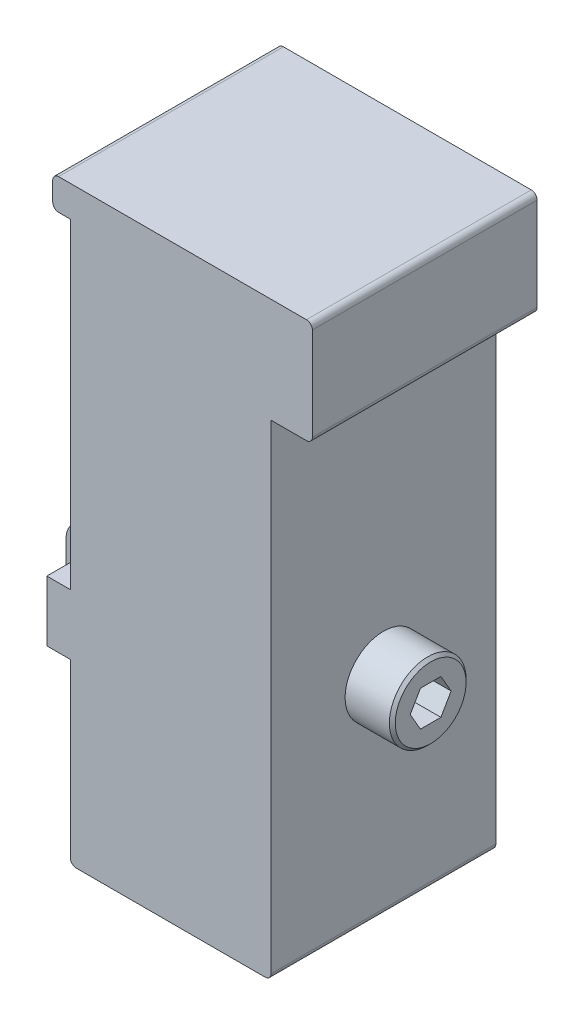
ISO-10303-21;
HEADER;
FILE_DESCRIPTION(('STEP AP214'),'2;1');
FILE_NAME('part.step','',(''),(''),'','','');
FILE_SCHEMA(('AUTOMOTIVE_DESIGN { 1 0 10303 214 1 1 1 1 }'));
ENDSEC;
DATA;
#1=APPLICATION_CONTEXT('core data for automotive mechanical design processes');
#2=APPLICATION_PROTOCOL_DEFINITION('international standard','automotive_design',2000,#1);
#3=PRODUCT_CONTEXT('',#1,'mechanical');
#4=PRODUCT('Part','Part','',(#3));
#5=PRODUCT_RELATED_PRODUCT_CATEGORY('part','',(#4));
#6=PRODUCT_DEFINITION_FORMATION('','',#4);
#7=PRODUCT_DEFINITION_CONTEXT('part definition',#1,'design');
#8=PRODUCT_DEFINITION('design','',#6,#7);
#9=PRODUCT_DEFINITION_SHAPE('','',#8);
#10=(LENGTH_UNIT() NAMED_UNIT(*) SI_UNIT(.MILLI.,.METRE.));
#11=(NAMED_UNIT(*) PLANE_ANGLE_UNIT() SI_UNIT($,.RADIAN.));
#12=(NAMED_UNIT(*) SI_UNIT($,.STERADIAN.) SOLID_ANGLE_UNIT());
#13=UNCERTAINTY_MEASURE_WITH_UNIT(LENGTH_MEASURE(1.E-05),#10,'distance_accuracy_value','');
#14=(GEOMETRIC_REPRESENTATION_CONTEXT(3) GLOBAL_UNCERTAINTY_ASSIGNED_CONTEXT((#13)) GLOBAL_UNIT_ASSIGNED_CONTEXT((#10,
#11,#12)) REPRESENTATION_CONTEXT('',''));
#15=CARTESIAN_POINT('',(0.,0.,0.));
#16=DIRECTION('',(0.,0.,1.));
#17=DIRECTION('',(1.,0.,0.));
#18=AXIS2_PLACEMENT_3D('',#15,#16,#17);
#19=CARTESIAN_POINT('',(164.000000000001,4.75000000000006,100.212073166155));
#20=DIRECTION('',(-1.,0.,0.));
#21=DIRECTION('',(0.,0.,-1.));
#22=AXIS2_PLACEMENT_3D('',#19,#20,#21);
#23=PLANE('',#22);
#24=CARTESIAN_POINT('',(164.000000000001,40.0000000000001,100.212073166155));
#25=DIRECTION('',(1.,0.,0.));
#26=DIRECTION('',(0.,0.,-1.));
#27=AXIS2_PLACEMENT_3D('',#24,#25,#26);
#28=CIRCLE('',#27,7.5);
#29=CARTESIAN_POINT('',(164.000000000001,45.1250000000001,105.687872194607));
#30=VERTEX_POINT('',#29);
#31=CARTESIAN_POINT('',(164.000000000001,34.875,105.687872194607));
#32=VERTEX_POINT('',#31);
#33=EDGE_CURVE('P0_E192',#30,#32,#28,.T.);
#34=ORIENTED_EDGE('',*,*,#33,.T.);
#35=DIRECTION('',(0.,0.,-1.));
#36=VECTOR('',#35,1.);
#37=CARTESIAN_POINT('',(164.000000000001,34.8750000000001,119.262073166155));
#38=LINE('',#37,#36);
#39=CARTESIAN_POINT('',(164.000000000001,34.8750000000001,119.262073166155));
#40=VERTEX_POINT('',#39);
#41=EDGE_CURVE('P0_E217',#40,#32,#38,.T.);
#42=ORIENTED_EDGE('',*,*,#41,.F.);
#43=DIRECTION('',(0.,-1.,0.));
#44=VECTOR('',#43,1.);
#45=CARTESIAN_POINT('',(164.000000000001,45.1250000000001,119.262073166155));
#46=LINE('',#45,#44);
#47=CARTESIAN_POINT('',(164.000000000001,45.1250000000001,119.262073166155));
#48=VERTEX_POINT('',#47);
#49=EDGE_CURVE('P0_E207',#48,#40,#46,.T.);
#50=ORIENTED_EDGE('',*,*,#49,.F.);
#51=DIRECTION('',(0.,0.,1.));
#52=VECTOR('',#51,1.);
#53=CARTESIAN_POINT('',(164.000000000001,45.1250000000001,119.262073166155));
#54=LINE('',#53,#52);
#55=EDGE_CURVE('P0_E208',#30,#48,#54,.T.);
#56=ORIENTED_EDGE('',*,*,#55,.F.);
#57=EDGE_LOOP('',(#34,#42,#50,#56));
#58=FACE_BOUND('',#57,.T.);
#59=ADVANCED_FACE('P0_F36',(#58),#23,.T.);
#60=CARTESIAN_POINT('',(164.000000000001,45.1250000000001,119.262073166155));
#61=DIRECTION('',(0.,-1.,0.));
#62=DIRECTION('',(1.,0.,0.));
#63=AXIS2_PLACEMENT_3D('',#60,#61,#62);
#64=PLANE('',#63);
#65=DIRECTION('',(0.,0.,1.));
#66=VECTOR('',#65,1.);
#67=CARTESIAN_POINT('',(168.000000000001,45.125,119.262073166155));
#68=LINE('',#67,#66);
#69=CARTESIAN_POINT('',(168.000000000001,45.125,81.1620731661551));
#70=VERTEX_POINT('',#69);
#71=CARTESIAN_POINT('',(168.000000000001,45.125,94.7362741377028));
#72=VERTEX_POINT('',#71);
#73=EDGE_CURVE('P0_E220',#70,#72,#68,.T.);
#74=ORIENTED_EDGE('',*,*,#73,.F.);
#75=DIRECTION('',(1.,0.,0.));
#76=VECTOR('',#75,1.);
#77=CARTESIAN_POINT('',(164.000000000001,45.1250000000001,81.1620731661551));
#78=LINE('',#77,#76);
#79=CARTESIAN_POINT('',(164.000000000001,45.1250000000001,81.1620731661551));
#80=VERTEX_POINT('',#79);
#81=EDGE_CURVE('P0_E206',#80,#70,#78,.T.);
#82=ORIENTED_EDGE('',*,*,#81,.F.);
#83=CARTESIAN_POINT('',(164.000000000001,45.1250000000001,94.7362741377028));
#84=VERTEX_POINT('',#83);
#85=EDGE_CURVE('P0_E189',#80,#84,#54,.T.);
#86=ORIENTED_EDGE('',*,*,#85,.T.);
#87=DIRECTION('',(-1.,0.,0.));
#88=VECTOR('',#87,1.);
#89=CARTESIAN_POINT('',(189.213203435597,45.125,94.7362741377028));
#90=LINE('',#89,#88);
#91=EDGE_CURVE('P0_E195',#72,#84,#90,.T.);
#92=ORIENTED_EDGE('',*,*,#91,.F.);
#93=EDGE_LOOP('',(#74,#82,#86,#92));
#94=FACE_BOUND('',#93,.T.);
#95=ADVANCED_FACE('P0_F204',(#94),#64,.F.);
#96=CARTESIAN_POINT('',(164.000000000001,34.8750000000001,119.262073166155));
#97=DIRECTION('',(0.,1.,0.));
#98=DIRECTION('',(-1.,0.,0.));
#99=AXIS2_PLACEMENT_3D('',#96,#97,#98);
#100=PLANE('',#99);
#101=DIRECTION('',(0.,0.,-1.));
#102=VECTOR('',#101,1.);
#103=CARTESIAN_POINT('',(168.000000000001,34.8750000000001,119.262073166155));
#104=LINE('',#103,#102);
#105=CARTESIAN_POINT('',(168.000000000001,34.8750000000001,119.262073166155));
#106=VERTEX_POINT('',#105);
#107=CARTESIAN_POINT('',(168.000000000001,34.875,105.687872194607));
#108=VERTEX_POINT('',#107);
#109=EDGE_CURVE('P0_E224',#106,#108,#104,.T.);
#110=ORIENTED_EDGE('',*,*,#109,.F.);
#111=DIRECTION('',(1.,0.,0.));
#112=VECTOR('',#111,1.);
#113=CARTESIAN_POINT('',(164.000000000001,34.8750000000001,119.262073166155));
#114=LINE('',#113,#112);
#115=EDGE_CURVE('P0_E228',#40,#106,#114,.T.);
#116=ORIENTED_EDGE('',*,*,#115,.F.);
#117=ORIENTED_EDGE('',*,*,#41,.T.);
#118=DIRECTION('',(-1.,0.,0.));
#119=VECTOR('',#118,1.);
#120=CARTESIAN_POINT('',(189.213203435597,34.875,105.687872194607));
#121=LINE('',#120,#119);
#122=EDGE_CURVE('P0_E11',#108,#32,#121,.T.);
#123=ORIENTED_EDGE('',*,*,#122,.F.);
#124=EDGE_LOOP('',(#110,#116,#117,#123));
#125=FACE_BOUND('',#124,.T.);
#126=ADVANCED_FACE('P0_F393',(#125),#100,.F.);
#127=CARTESIAN_POINT('',(168.000000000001,4.75000000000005,81.1620731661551));
#128=DIRECTION('',(1.,0.,0.));
#129=DIRECTION('',(0.,0.,1.));
#130=AXIS2_PLACEMENT_3D('',#127,#128,#129);
#131=PLANE('',#130);
#132=CARTESIAN_POINT('',(168.000000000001,34.875,94.7362741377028));
#133=VERTEX_POINT('',#132);
#134=CARTESIAN_POINT('',(168.000000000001,34.875,81.1620731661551));
#135=VERTEX_POINT('',#134);
#136=EDGE_CURVE('P0_E222',#133,#135,#104,.T.);
#137=ORIENTED_EDGE('',*,*,#136,.T.);
#138=DIRECTION('',(0.,-1.,0.));
#139=VECTOR('',#138,1.);
#140=CARTESIAN_POINT('',(168.000000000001,4.75000000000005,81.1620731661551));
#141=LINE('',#140,#139);
#142=CARTESIAN_POINT('',(168.000000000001,5.75000000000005,81.1620731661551));
#143=VERTEX_POINT('',#142);
#144=EDGE_CURVE('P0_E259',#135,#143,#141,.T.);
#145=ORIENTED_EDGE('',*,*,#144,.T.);
#146=DIRECTION('',(0.,0.,1.));
#147=VECTOR('',#146,1.);
#148=CARTESIAN_POINT('',(168.000000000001,5.75000000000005,81.1620731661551));
#149=LINE('',#148,#147);
#150=CARTESIAN_POINT('',(168.000000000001,5.75000000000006,119.262073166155));
#151=VERTEX_POINT('',#150);
#152=EDGE_CURVE('P0_E308',#151,#143,#149,.F.);
#153=ORIENTED_EDGE('',*,*,#152,.F.);
#154=DIRECTION('',(0.,-1.,0.));
#155=VECTOR('',#154,1.);
#156=CARTESIAN_POINT('',(168.000000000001,4.75000000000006,119.262073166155));
#157=LINE('',#156,#155);
#158=EDGE_CURVE('P0_E282',#106,#151,#157,.T.);
#159=ORIENTED_EDGE('',*,*,#158,.F.);
#160=ORIENTED_EDGE('',*,*,#109,.T.);
#161=CARTESIAN_POINT('',(168.000000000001,40.,100.212073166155));
#162=DIRECTION('',(-1.,0.,0.));
#163=DIRECTION('',(0.,0.,1.));
#164=AXIS2_PLACEMENT_3D('',#161,#162,#163);
#165=CIRCLE('',#164,7.5);
#166=CARTESIAN_POINT('',(168.000000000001,45.125,105.687872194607));
#167=VERTEX_POINT('',#166);
#168=EDGE_CURVE('P0_E376',#167,#108,#165,.F.);
#169=ORIENTED_EDGE('',*,*,#168,.F.);
#170=CARTESIAN_POINT('',(168.000000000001,45.125,119.262073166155));
#171=VERTEX_POINT('',#170);
#172=EDGE_CURVE('P0_E223',#167,#171,#68,.T.);
#173=ORIENTED_EDGE('',*,*,#172,.T.);
#174=CARTESIAN_POINT('',(168.000000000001,99.5000000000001,119.262073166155));
#175=VERTEX_POINT('',#174);
#176=EDGE_CURVE('P0_E242',#175,#171,#157,.T.);
#177=ORIENTED_EDGE('',*,*,#176,.F.);
#178=DIRECTION('',(0.,0.,1.));
#179=VECTOR('',#178,1.);
#180=CARTESIAN_POINT('',(168.000000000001,99.5000000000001,81.1620731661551));
#181=LINE('',#180,#179);
#182=CARTESIAN_POINT('',(168.000000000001,99.5000000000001,81.1620731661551));
#183=VERTEX_POINT('',#182);
#184=EDGE_CURVE('P0_E262',#183,#175,#181,.T.);
#185=ORIENTED_EDGE('',*,*,#184,.F.);
#186=EDGE_CURVE('P0_E260',#183,#70,#141,.T.);
#187=ORIENTED_EDGE('',*,*,#186,.T.);
#188=ORIENTED_EDGE('',*,*,#73,.T.);
#189=EDGE_CURVE('P0_E197',#133,#72,#165,.F.);
#190=ORIENTED_EDGE('',*,*,#189,.F.);
#191=EDGE_LOOP('',(#137,#145,#153,#159,#160,#169,#173,#177,#185,#187,#188,#190));
#192=FACE_BOUND('',#191,.T.);
#193=CARTESIAN_POINT('',(168.000000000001,40.0000000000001,100.212073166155));
#194=DIRECTION('',(-1.,0.,0.));
#195=DIRECTION('',(0.,0.,1.));
#196=AXIS2_PLACEMENT_3D('',#193,#194,#195);
#197=CIRCLE('',#196,4.1);
#198=CARTESIAN_POINT('',(168.000000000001,40.0000000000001,104.312073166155));
#199=VERTEX_POINT('',#198);
#200=EDGE_CURVE('P0_E201',#199,#199,#197,.F.);
#201=ORIENTED_EDGE('',*,*,#200,.T.);
#202=EDGE_LOOP('',(#201));
#203=FACE_BOUND('',#202,.T.);
#204=ADVANCED_FACE('P0_F372',(#192,#203),#131,.F.);
#205=CARTESIAN_POINT('',(202.000000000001,4.75000000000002,81.1620731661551));
#206=DIRECTION('',(0.,1.,0.));
#207=DIRECTION('',(-1.,0.,0.));
#208=AXIS2_PLACEMENT_3D('',#205,#206,#207);
#209=PLANE('',#208);
#210=DIRECTION('',(1.,0.,0.));
#211=VECTOR('',#210,1.);
#212=CARTESIAN_POINT('',(202.000000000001,4.75000000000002,81.1620731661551));
#213=LINE('',#212,#211);
#214=CARTESIAN_POINT('',(169.000000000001,4.75000000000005,81.1620731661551));
#215=VERTEX_POINT('',#214);
#216=CARTESIAN_POINT('',(201.000000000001,4.75000000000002,81.1620731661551));
#217=VERTEX_POINT('',#216);
#218=EDGE_CURVE('P0_E238',#215,#217,#213,.T.);
#219=ORIENTED_EDGE('',*,*,#218,.T.);
#220=DIRECTION('',(0.,0.,1.));
#221=VECTOR('',#220,1.);
#222=CARTESIAN_POINT('',(201.000000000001,4.75000000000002,81.1620731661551));
#223=LINE('',#222,#221);
#224=CARTESIAN_POINT('',(201.000000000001,4.75000000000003,119.262073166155));
#225=VERTEX_POINT('',#224);
#226=EDGE_CURVE('P0_E290',#225,#217,#223,.F.);
#227=ORIENTED_EDGE('',*,*,#226,.F.);
#228=DIRECTION('',(1.,0.,0.));
#229=VECTOR('',#228,1.);
#230=CARTESIAN_POINT('',(202.000000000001,4.75000000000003,119.262073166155));
#231=LINE('',#230,#229);
#232=CARTESIAN_POINT('',(169.000000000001,4.75000000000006,119.262073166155));
#233=VERTEX_POINT('',#232);
#234=EDGE_CURVE('P0_E237',#233,#225,#231,.T.);
#235=ORIENTED_EDGE('',*,*,#234,.F.);
#236=DIRECTION('',(0.,0.,1.));
#237=VECTOR('',#236,1.);
#238=CARTESIAN_POINT('',(169.000000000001,4.75000000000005,81.1620731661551));
#239=LINE('',#238,#237);
#240=EDGE_CURVE('P0_E293',#215,#233,#239,.T.);
#241=ORIENTED_EDGE('',*,*,#240,.F.);
#242=EDGE_LOOP('',(#219,#227,#235,#241));
#243=FACE_BOUND('',#242,.T.);
#244=ADVANCED_FACE('P0_F574',(#243),#209,.F.);
#245=CARTESIAN_POINT('',(202.000000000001,87.,81.1620731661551));
#246=DIRECTION('',(-1.,0.,0.));
#247=DIRECTION('',(0.,-1.,0.));
#248=AXIS2_PLACEMENT_3D('',#245,#246,#247);
#249=PLANE('',#248);
#250=CARTESIAN_POINT('',(202.000000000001,40.,100.212073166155));
#251=DIRECTION('',(-1.,0.,0.));
#252=DIRECTION('',(0.,1.,0.));
#253=AXIS2_PLACEMENT_3D('',#250,#251,#252);
#254=CIRCLE('',#253,4.1);
#255=CARTESIAN_POINT('',(202.000000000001,44.1,100.212073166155));
#256=VERTEX_POINT('',#255);
#257=EDGE_CURVE('P0_E234',#256,#256,#254,.T.);
#258=ORIENTED_EDGE('',*,*,#257,.T.);
#259=EDGE_LOOP('',(#258));
#260=FACE_BOUND('',#259,.T.);
#261=DIRECTION('',(0.,1.,0.));
#262=VECTOR('',#261,1.);
#263=CARTESIAN_POINT('',(202.000000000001,87.,81.1620731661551));
#264=LINE('',#263,#262);
#265=CARTESIAN_POINT('',(202.000000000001,5.75000000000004,81.1620731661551));
#266=VERTEX_POINT('',#265);
#267=CARTESIAN_POINT('',(202.000000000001,87.,81.1620731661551));
#268=VERTEX_POINT('',#267);
#269=EDGE_CURVE('P0_E241',#266,#268,#264,.T.);
#270=ORIENTED_EDGE('',*,*,#269,.T.);
#271=DIRECTION('',(0.,0.,1.));
#272=VECTOR('',#271,1.);
#273=CARTESIAN_POINT('',(202.000000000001,87.,81.1620731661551));
#274=LINE('',#273,#272);
#275=CARTESIAN_POINT('',(202.000000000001,87.,119.262073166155));
#276=VERTEX_POINT('',#275);
#277=EDGE_CURVE('P0_E287',#268,#276,#274,.T.);
#278=ORIENTED_EDGE('',*,*,#277,.T.);
#279=DIRECTION('',(0.,1.,0.));
#280=VECTOR('',#279,1.);
#281=CARTESIAN_POINT('',(202.000000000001,87.,119.262073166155));
#282=LINE('',#281,#280);
#283=CARTESIAN_POINT('',(202.000000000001,5.75000000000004,119.262073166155));
#284=VERTEX_POINT('',#283);
#285=EDGE_CURVE('P0_E265',#284,#276,#282,.T.);
#286=ORIENTED_EDGE('',*,*,#285,.F.);
#287=DIRECTION('',(0.,0.,1.));
#288=VECTOR('',#287,1.);
#289=CARTESIAN_POINT('',(202.000000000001,5.75000000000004,81.1620731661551));
#290=LINE('',#289,#288);
#291=EDGE_CURVE('P0_E323',#266,#284,#290,.T.);
#292=ORIENTED_EDGE('',*,*,#291,.F.);
#293=EDGE_LOOP('',(#270,#278,#286,#292));
#294=FACE_BOUND('',#293,.T.);
#295=ADVANCED_FACE('P0_F564',(#260,#294),#249,.F.);
#296=CARTESIAN_POINT('',(209.000000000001,87.,81.1620731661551));
#297=DIRECTION('',(0.,1.,0.));
#298=DIRECTION('',(-1.,0.,0.));
#299=AXIS2_PLACEMENT_3D('',#296,#297,#298);
#300=PLANE('',#299);
#301=DIRECTION('',(1.,0.,0.));
#302=VECTOR('',#301,1.);
#303=CARTESIAN_POINT('',(209.000000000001,87.,119.262073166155));
#304=LINE('',#303,#302);
#305=CARTESIAN_POINT('',(208.000000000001,87.,119.262073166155));
#306=VERTEX_POINT('',#305);
#307=EDGE_CURVE('P0_E268',#276,#306,#304,.T.);
#308=ORIENTED_EDGE('',*,*,#307,.F.);
#309=ORIENTED_EDGE('',*,*,#277,.F.);
#310=DIRECTION('',(1.,0.,0.));
#311=VECTOR('',#310,1.);
#312=CARTESIAN_POINT('',(209.000000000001,87.,81.1620731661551));
#313=LINE('',#312,#311);
#314=CARTESIAN_POINT('',(208.000000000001,87.,81.1620731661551));
#315=VERTEX_POINT('',#314);
#316=EDGE_CURVE('P0_E245',#268,#315,#313,.T.);
#317=ORIENTED_EDGE('',*,*,#316,.T.);
#318=DIRECTION('',(0.,0.,1.));
#319=VECTOR('',#318,1.);
#320=CARTESIAN_POINT('',(208.000000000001,87.,81.1620731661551));
#321=LINE('',#320,#319);
#322=EDGE_CURVE('P0_E332',#306,#315,#321,.F.);
#323=ORIENTED_EDGE('',*,*,#322,.F.);
#324=EDGE_LOOP('',(#308,#309,#317,#323));
#325=FACE_BOUND('',#324,.T.);
#326=ADVANCED_FACE('P0_F554',(#325),#300,.F.);
#327=CARTESIAN_POINT('',(209.000000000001,104.75,81.1620731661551));
#328=DIRECTION('',(-1.,0.,0.));
#329=DIRECTION('',(0.,0.,-1.));
#330=AXIS2_PLACEMENT_3D('',#327,#328,#329);
#331=PLANE('',#330);
#332=DIRECTION('',(0.,1.,0.));
#333=VECTOR('',#332,1.);
#334=CARTESIAN_POINT('',(209.000000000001,104.75,81.1620731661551));
#335=LINE('',#334,#333);
#336=CARTESIAN_POINT('',(209.000000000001,88.,81.1620731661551));
#337=VERTEX_POINT('',#336);
#338=CARTESIAN_POINT('',(209.000000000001,103.75,81.1620731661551));
#339=VERTEX_POINT('',#338);
#340=EDGE_CURVE('P0_E248',#337,#339,#335,.T.);
#341=ORIENTED_EDGE('',*,*,#340,.T.);
#342=DIRECTION('',(0.,0.,1.));
#343=VECTOR('',#342,1.);
#344=CARTESIAN_POINT('',(209.000000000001,103.75,81.1620731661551));
#345=LINE('',#344,#343);
#346=CARTESIAN_POINT('',(209.000000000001,103.75,119.262073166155));
#347=VERTEX_POINT('',#346);
#348=EDGE_CURVE('P0_E326',#347,#339,#345,.F.);
#349=ORIENTED_EDGE('',*,*,#348,.F.);
#350=DIRECTION('',(0.,1.,0.));
#351=VECTOR('',#350,1.);
#352=CARTESIAN_POINT('',(209.000000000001,104.75,119.262073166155));
#353=LINE('',#352,#351);
#354=CARTESIAN_POINT('',(209.000000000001,88.,119.262073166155));
#355=VERTEX_POINT('',#354);
#356=EDGE_CURVE('P0_E271',#355,#347,#353,.T.);
#357=ORIENTED_EDGE('',*,*,#356,.F.);
#358=DIRECTION('',(0.,0.,1.));
#359=VECTOR('',#358,1.);
#360=CARTESIAN_POINT('',(209.000000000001,88.,81.1620731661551));
#361=LINE('',#360,#359);
#362=EDGE_CURVE('P0_E329',#337,#355,#361,.T.);
#363=ORIENTED_EDGE('',*,*,#362,.F.);
#364=EDGE_LOOP('',(#341,#349,#357,#363));
#365=FACE_BOUND('',#364,.T.);
#366=ADVANCED_FACE('P0_F544',(#365),#331,.F.);
#367=CARTESIAN_POINT('',(165.000000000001,104.75,81.1620731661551));
#368=DIRECTION('',(0.,-1.,0.));
#369=DIRECTION('',(1.,0.,0.));
#370=AXIS2_PLACEMENT_3D('',#367,#368,#369);
#371=PLANE('',#370);
#372=DIRECTION('',(-1.,0.,0.));
#373=VECTOR('',#372,1.);
#374=CARTESIAN_POINT('',(165.000000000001,104.75,81.1620731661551));
#375=LINE('',#374,#373);
#376=CARTESIAN_POINT('',(208.000000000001,104.75,81.1620731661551));
#377=VERTEX_POINT('',#376);
#378=CARTESIAN_POINT('',(166.000000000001,104.75,81.1620731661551));
#379=VERTEX_POINT('',#378);
#380=EDGE_CURVE('P0_E251',#377,#379,#375,.T.);
#381=ORIENTED_EDGE('',*,*,#380,.T.);
#382=DIRECTION('',(0.,0.,1.));
#383=VECTOR('',#382,1.);
#384=CARTESIAN_POINT('',(166.000000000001,104.75,81.1620731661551));
#385=LINE('',#384,#383);
#386=CARTESIAN_POINT('',(166.000000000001,104.75,119.262073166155));
#387=VERTEX_POINT('',#386);
#388=EDGE_CURVE('P0_E335',#387,#379,#385,.F.);
#389=ORIENTED_EDGE('',*,*,#388,.F.);
#390=DIRECTION('',(-1.,0.,0.));
#391=VECTOR('',#390,1.);
#392=CARTESIAN_POINT('',(165.000000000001,104.75,119.262073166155));
#393=LINE('',#392,#391);
#394=CARTESIAN_POINT('',(208.000000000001,104.75,119.262073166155));
#395=VERTEX_POINT('',#394);
#396=EDGE_CURVE('P0_E274',#395,#387,#393,.T.);
#397=ORIENTED_EDGE('',*,*,#396,.F.);
#398=DIRECTION('',(0.,0.,1.));
#399=VECTOR('',#398,1.);
#400=CARTESIAN_POINT('',(208.000000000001,104.75,81.1620731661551));
#401=LINE('',#400,#399);
#402=EDGE_CURVE('P0_E338',#377,#395,#401,.T.);
#403=ORIENTED_EDGE('',*,*,#402,.F.);
#404=EDGE_LOOP('',(#381,#389,#397,#403));
#405=FACE_BOUND('',#404,.T.);
#406=ADVANCED_FACE('P0_F535',(#405),#371,.F.);
#407=CARTESIAN_POINT('',(165.000000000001,99.5000000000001,81.1620731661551));
#408=DIRECTION('',(1.,0.,0.));
#409=DIRECTION('',(0.,0.,1.));
#410=AXIS2_PLACEMENT_3D('',#407,#408,#409);
#411=PLANE('',#410);
#412=DIRECTION('',(0.,-1.,0.));
#413=VECTOR('',#412,1.);
#414=CARTESIAN_POINT('',(165.000000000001,99.5000000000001,81.1620731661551));
#415=LINE('',#414,#413);
#416=CARTESIAN_POINT('',(165.000000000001,103.75,81.1620731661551));
#417=VERTEX_POINT('',#416);
#418=CARTESIAN_POINT('',(165.000000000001,100.5,81.1620731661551));
#419=VERTEX_POINT('',#418);
#420=EDGE_CURVE('P0_E254',#417,#419,#415,.T.);
#421=ORIENTED_EDGE('',*,*,#420,.T.);
#422=DIRECTION('',(0.,0.,1.));
#423=VECTOR('',#422,1.);
#424=CARTESIAN_POINT('',(165.000000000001,100.5,81.1620731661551));
#425=LINE('',#424,#423);
#426=CARTESIAN_POINT('',(165.000000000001,100.5,119.262073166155));
#427=VERTEX_POINT('',#426);
#428=EDGE_CURVE('P0_E341',#427,#419,#425,.F.);
#429=ORIENTED_EDGE('',*,*,#428,.F.);
#430=DIRECTION('',(0.,-1.,0.));
#431=VECTOR('',#430,1.);
#432=CARTESIAN_POINT('',(165.000000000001,99.5000000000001,119.262073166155));
#433=LINE('',#432,#431);
#434=CARTESIAN_POINT('',(165.000000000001,103.75,119.262073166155));
#435=VERTEX_POINT('',#434);
#436=EDGE_CURVE('P0_E277',#435,#427,#433,.T.);
#437=ORIENTED_EDGE('',*,*,#436,.F.);
#438=DIRECTION('',(0.,0.,1.));
#439=VECTOR('',#438,1.);
#440=CARTESIAN_POINT('',(165.000000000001,103.75,81.1620731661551));
#441=LINE('',#440,#439);
#442=EDGE_CURVE('P0_E344',#417,#435,#441,.T.);
#443=ORIENTED_EDGE('',*,*,#442,.F.);
#444=EDGE_LOOP('',(#421,#429,#437,#443));
#445=FACE_BOUND('',#444,.T.);
#446=ADVANCED_FACE('P0_F364',(#445),#411,.F.);
#447=CARTESIAN_POINT('',(168.000000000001,99.5000000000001,81.1620731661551));
#448=DIRECTION('',(0.,1.,0.));
#449=DIRECTION('',(-1.,0.,0.));
#450=AXIS2_PLACEMENT_3D('',#447,#448,#449);
#451=PLANE('',#450);
#452=DIRECTION('',(1.,0.,0.));
#453=VECTOR('',#452,1.);
#454=CARTESIAN_POINT('',(168.000000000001,99.5000000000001,81.1620731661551));
#455=LINE('',#454,#453);
#456=CARTESIAN_POINT('',(166.000000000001,99.5000000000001,81.1620731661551));
#457=VERTEX_POINT('',#456);
#458=EDGE_CURVE('P0_E257',#457,#183,#455,.T.);
#459=ORIENTED_EDGE('',*,*,#458,.T.);
#460=ORIENTED_EDGE('',*,*,#184,.T.);
#461=DIRECTION('',(1.,0.,0.));
#462=VECTOR('',#461,1.);
#463=CARTESIAN_POINT('',(168.000000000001,99.5000000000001,119.262073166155));
#464=LINE('',#463,#462);
#465=CARTESIAN_POINT('',(166.000000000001,99.5000000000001,119.262073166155));
#466=VERTEX_POINT('',#465);
#467=EDGE_CURVE('P0_E280',#466,#175,#464,.T.);
#468=ORIENTED_EDGE('',*,*,#467,.F.);
#469=DIRECTION('',(0.,0.,1.));
#470=VECTOR('',#469,1.);
#471=CARTESIAN_POINT('',(166.000000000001,99.5000000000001,81.1620731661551));
#472=LINE('',#471,#470);
#473=EDGE_CURVE('P0_E347',#457,#466,#472,.T.);
#474=ORIENTED_EDGE('',*,*,#473,.F.);
#475=EDGE_LOOP('',(#459,#460,#468,#474));
#476=FACE_BOUND('',#475,.T.);
#477=ADVANCED_FACE('P0_F354',(#476),#451,.F.);
#478=CARTESIAN_POINT('',(168.000000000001,4.75000000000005,81.1620731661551));
#479=DIRECTION('',(0.,0.,1.));
#480=DIRECTION('',(-1.,0.,0.));
#481=AXIS2_PLACEMENT_3D('',#478,#479,#480);
#482=PLANE('',#481);
#483=ORIENTED_EDGE('',*,*,#186,.F.);
#484=ORIENTED_EDGE('',*,*,#458,.F.);
#485=CARTESIAN_POINT('',(166.000000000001,100.5,81.1620731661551));
#486=DIRECTION('',(0.,0.,-1.));
#487=DIRECTION('',(-1.,0.,0.));
#488=AXIS2_PLACEMENT_3D('',#485,#486,#487);
#489=CIRCLE('',#488,1.);
#490=EDGE_CURVE('P0_E311',#419,#457,#489,.F.);
#491=ORIENTED_EDGE('',*,*,#490,.F.);
#492=ORIENTED_EDGE('',*,*,#420,.F.);
#493=CARTESIAN_POINT('',(166.000000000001,103.75,81.1620731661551));
#494=DIRECTION('',(0.,0.,-1.));
#495=DIRECTION('',(-1.,0.,0.));
#496=AXIS2_PLACEMENT_3D('',#493,#494,#495);
#497=CIRCLE('',#496,1.);
#498=EDGE_CURVE('P0_E313',#379,#417,#497,.F.);
#499=ORIENTED_EDGE('',*,*,#498,.F.);
#500=ORIENTED_EDGE('',*,*,#380,.F.);
#501=CARTESIAN_POINT('',(208.000000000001,103.75,81.1620731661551));
#502=DIRECTION('',(0.,0.,-1.));
#503=DIRECTION('',(-1.,0.,0.));
#504=AXIS2_PLACEMENT_3D('',#501,#502,#503);
#505=CIRCLE('',#504,1.);
#506=EDGE_CURVE('P0_E315',#339,#377,#505,.F.);
#507=ORIENTED_EDGE('',*,*,#506,.F.);
#508=ORIENTED_EDGE('',*,*,#340,.F.);
#509=CARTESIAN_POINT('',(208.000000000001,88.,81.1620731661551));
#510=DIRECTION('',(0.,0.,-1.));
#511=DIRECTION('',(-1.,0.,0.));
#512=AXIS2_PLACEMENT_3D('',#509,#510,#511);
#513=CIRCLE('',#512,1.);
#514=EDGE_CURVE('P0_E317',#315,#337,#513,.F.);
#515=ORIENTED_EDGE('',*,*,#514,.F.);
#516=ORIENTED_EDGE('',*,*,#316,.F.);
#517=ORIENTED_EDGE('',*,*,#269,.F.);
#518=CARTESIAN_POINT('',(201.000000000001,5.75000000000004,81.1620731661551));
#519=DIRECTION('',(0.,0.,-1.));
#520=DIRECTION('',(-1.,0.,0.));
#521=AXIS2_PLACEMENT_3D('',#518,#519,#520);
#522=CIRCLE('',#521,1.);
#523=EDGE_CURVE('P0_E319',#217,#266,#522,.F.);
#524=ORIENTED_EDGE('',*,*,#523,.F.);
#525=ORIENTED_EDGE('',*,*,#218,.F.);
#526=CARTESIAN_POINT('',(169.000000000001,5.75000000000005,81.1620731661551));
#527=DIRECTION('',(0.,0.,-1.));
#528=DIRECTION('',(-1.,0.,0.));
#529=AXIS2_PLACEMENT_3D('',#526,#527,#528);
#530=CIRCLE('',#529,1.);
#531=EDGE_CURVE('P0_E321',#143,#215,#530,.F.);
#532=ORIENTED_EDGE('',*,*,#531,.F.);
#533=ORIENTED_EDGE('',*,*,#144,.F.);
#534=DIRECTION('',(1.,0.,0.));
#535=VECTOR('',#534,1.);
#536=CARTESIAN_POINT('',(164.000000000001,34.875,81.1620731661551));
#537=LINE('',#536,#535);
#538=CARTESIAN_POINT('',(164.000000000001,34.875,81.1620731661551));
#539=VERTEX_POINT('',#538);
#540=EDGE_CURVE('P0_E58',#539,#135,#537,.T.);
#541=ORIENTED_EDGE('',*,*,#540,.F.);
#542=DIRECTION('',(0.,1.,0.));
#543=VECTOR('',#542,1.);
#544=CARTESIAN_POINT('',(164.000000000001,45.1250000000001,81.1620731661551));
#545=LINE('',#544,#543);
#546=EDGE_CURVE('P0_E213',#539,#80,#545,.T.);
#547=ORIENTED_EDGE('',*,*,#546,.T.);
#548=ORIENTED_EDGE('',*,*,#81,.T.);
#549=EDGE_LOOP('',(#483,#484,#491,#492,#499,#500,#507,#508,#515,#516,#517,#524,#525,#532,#533,
#541,#547,#548));
#550=FACE_BOUND('',#549,.T.);
#551=ADVANCED_FACE('P0_F368',(#550),#482,.F.);
#552=CARTESIAN_POINT('',(168.000000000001,4.75000000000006,119.262073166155));
#553=DIRECTION('',(0.,0.,1.));
#554=DIRECTION('',(-1.,0.,0.));
#555=AXIS2_PLACEMENT_3D('',#552,#553,#554);
#556=PLANE('',#555);
#557=ORIENTED_EDGE('',*,*,#234,.T.);
#558=CARTESIAN_POINT('',(201.000000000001,5.75000000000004,119.262073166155));
#559=DIRECTION('',(0.,0.,-1.));
#560=DIRECTION('',(-1.,0.,0.));
#561=AXIS2_PLACEMENT_3D('',#558,#559,#560);
#562=CIRCLE('',#561,1.);
#563=EDGE_CURVE('P0_E304',#284,#225,#562,.T.);
#564=ORIENTED_EDGE('',*,*,#563,.F.);
#565=ORIENTED_EDGE('',*,*,#285,.T.);
#566=ORIENTED_EDGE('',*,*,#307,.T.);
#567=CARTESIAN_POINT('',(208.000000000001,88.,119.262073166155));
#568=DIRECTION('',(0.,0.,-1.));
#569=DIRECTION('',(-1.,0.,0.));
#570=AXIS2_PLACEMENT_3D('',#567,#568,#569);
#571=CIRCLE('',#570,1.);
#572=EDGE_CURVE('P0_E302',#355,#306,#571,.T.);
#573=ORIENTED_EDGE('',*,*,#572,.F.);
#574=ORIENTED_EDGE('',*,*,#356,.T.);
#575=CARTESIAN_POINT('',(208.000000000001,103.75,119.262073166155));
#576=DIRECTION('',(0.,0.,-1.));
#577=DIRECTION('',(-1.,0.,0.));
#578=AXIS2_PLACEMENT_3D('',#575,#576,#577);
#579=CIRCLE('',#578,1.);
#580=EDGE_CURVE('P0_E300',#395,#347,#579,.T.);
#581=ORIENTED_EDGE('',*,*,#580,.F.);
#582=ORIENTED_EDGE('',*,*,#396,.T.);
#583=CARTESIAN_POINT('',(166.000000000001,103.75,119.262073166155));
#584=DIRECTION('',(0.,0.,-1.));
#585=DIRECTION('',(-1.,0.,0.));
#586=AXIS2_PLACEMENT_3D('',#583,#584,#585);
#587=CIRCLE('',#586,1.);
#588=EDGE_CURVE('P0_E298',#435,#387,#587,.T.);
#589=ORIENTED_EDGE('',*,*,#588,.F.);
#590=ORIENTED_EDGE('',*,*,#436,.T.);
#591=CARTESIAN_POINT('',(166.000000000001,100.5,119.262073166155));
#592=DIRECTION('',(0.,0.,-1.));
#593=DIRECTION('',(-1.,0.,0.));
#594=AXIS2_PLACEMENT_3D('',#591,#592,#593);
#595=CIRCLE('',#594,1.);
#596=EDGE_CURVE('P0_E296',#466,#427,#595,.T.);
#597=ORIENTED_EDGE('',*,*,#596,.F.);
#598=ORIENTED_EDGE('',*,*,#467,.T.);
#599=ORIENTED_EDGE('',*,*,#176,.T.);
#600=DIRECTION('',(1.,0.,0.));
#601=VECTOR('',#600,1.);
#602=CARTESIAN_POINT('',(164.000000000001,45.1250000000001,119.262073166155));
#603=LINE('',#602,#601);
#604=EDGE_CURVE('P0_E231',#48,#171,#603,.T.);
#605=ORIENTED_EDGE('',*,*,#604,.F.);
#606=ORIENTED_EDGE('',*,*,#49,.T.);
#607=ORIENTED_EDGE('',*,*,#115,.T.);
#608=ORIENTED_EDGE('',*,*,#158,.T.);
#609=CARTESIAN_POINT('',(169.000000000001,5.75000000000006,119.262073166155));
#610=DIRECTION('',(0.,0.,-1.));
#611=DIRECTION('',(-1.,0.,0.));
#612=AXIS2_PLACEMENT_3D('',#609,#610,#611);
#613=CIRCLE('',#612,1.);
#614=EDGE_CURVE('P0_E306',#233,#151,#613,.T.);
#615=ORIENTED_EDGE('',*,*,#614,.F.);
#616=EDGE_LOOP('',(#557,#564,#565,#566,#573,#574,#581,#582,#589,#590,#597,#598,#599,#605,#606,
#607,#608,#615));
#617=FACE_BOUND('',#616,.T.);
#618=ADVANCED_FACE('P0_F358',(#617),#556,.T.);
#619=CARTESIAN_POINT('',(169.000000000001,5.75000000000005,81.1620731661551));
#620=DIRECTION('',(0.,0.,1.));
#621=DIRECTION('',(-1.,0.,0.));
#622=AXIS2_PLACEMENT_3D('',#619,#620,#621);
#623=CYLINDRICAL_SURFACE('',#622,1.);
#624=ORIENTED_EDGE('',*,*,#531,.T.);
#625=ORIENTED_EDGE('',*,*,#240,.T.);
#626=ORIENTED_EDGE('',*,*,#614,.T.);
#627=ORIENTED_EDGE('',*,*,#152,.T.);
#628=EDGE_LOOP('',(#624,#625,#626,#627));
#629=FACE_BOUND('',#628,.T.);
#630=ADVANCED_FACE('P0_F492',(#629),#623,.T.);
#631=CARTESIAN_POINT('',(201.000000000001,5.75000000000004,81.1620731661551));
#632=DIRECTION('',(0.,0.,1.));
#633=DIRECTION('',(-1.,0.,0.));
#634=AXIS2_PLACEMENT_3D('',#631,#632,#633);
#635=CYLINDRICAL_SURFACE('',#634,1.);
#636=ORIENTED_EDGE('',*,*,#523,.T.);
#637=ORIENTED_EDGE('',*,*,#291,.T.);
#638=ORIENTED_EDGE('',*,*,#563,.T.);
#639=ORIENTED_EDGE('',*,*,#226,.T.);
#640=EDGE_LOOP('',(#636,#637,#638,#639));
#641=FACE_BOUND('',#640,.T.);
#642=ADVANCED_FACE('P0_F482',(#641),#635,.T.);
#643=CARTESIAN_POINT('',(208.000000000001,88.,81.1620731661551));
#644=DIRECTION('',(0.,0.,1.));
#645=DIRECTION('',(-1.,0.,0.));
#646=AXIS2_PLACEMENT_3D('',#643,#644,#645);
#647=CYLINDRICAL_SURFACE('',#646,1.);
#648=ORIENTED_EDGE('',*,*,#514,.T.);
#649=ORIENTED_EDGE('',*,*,#362,.T.);
#650=ORIENTED_EDGE('',*,*,#572,.T.);
#651=ORIENTED_EDGE('',*,*,#322,.T.);
#652=EDGE_LOOP('',(#648,#649,#650,#651));
#653=FACE_BOUND('',#652,.T.);
#654=ADVANCED_FACE('P0_F472',(#653),#647,.T.);
#655=CARTESIAN_POINT('',(208.000000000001,103.75,81.1620731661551));
#656=DIRECTION('',(0.,0.,1.));
#657=DIRECTION('',(-1.,0.,0.));
#658=AXIS2_PLACEMENT_3D('',#655,#656,#657);
#659=CYLINDRICAL_SURFACE('',#658,1.);
#660=ORIENTED_EDGE('',*,*,#506,.T.);
#661=ORIENTED_EDGE('',*,*,#402,.T.);
#662=ORIENTED_EDGE('',*,*,#580,.T.);
#663=ORIENTED_EDGE('',*,*,#348,.T.);
#664=EDGE_LOOP('',(#660,#661,#662,#663));
#665=FACE_BOUND('',#664,.T.);
#666=ADVANCED_FACE('P0_F463',(#665),#659,.T.);
#667=CARTESIAN_POINT('',(166.000000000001,103.75,81.1620731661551));
#668=DIRECTION('',(0.,0.,1.));
#669=DIRECTION('',(-1.,0.,0.));
#670=AXIS2_PLACEMENT_3D('',#667,#668,#669);
#671=CYLINDRICAL_SURFACE('',#670,1.);
#672=ORIENTED_EDGE('',*,*,#498,.T.);
#673=ORIENTED_EDGE('',*,*,#442,.T.);
#674=ORIENTED_EDGE('',*,*,#588,.T.);
#675=ORIENTED_EDGE('',*,*,#388,.T.);
#676=EDGE_LOOP('',(#672,#673,#674,#675));
#677=FACE_BOUND('',#676,.T.);
#678=ADVANCED_FACE('P0_F455',(#677),#671,.T.);
#679=CARTESIAN_POINT('',(166.000000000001,100.5,81.1620731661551));
#680=DIRECTION('',(0.,0.,1.));
#681=DIRECTION('',(-1.,0.,0.));
#682=AXIS2_PLACEMENT_3D('',#679,#680,#681);
#683=CYLINDRICAL_SURFACE('',#682,1.);
#684=ORIENTED_EDGE('',*,*,#490,.T.);
#685=ORIENTED_EDGE('',*,*,#473,.T.);
#686=ORIENTED_EDGE('',*,*,#596,.T.);
#687=ORIENTED_EDGE('',*,*,#428,.T.);
#688=EDGE_LOOP('',(#684,#685,#686,#687));
#689=FACE_BOUND('',#688,.T.);
#690=ADVANCED_FACE('P0_F38',(#689),#683,.T.);
#691=CARTESIAN_POINT('',(165.000000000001,40.0000000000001,100.212073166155));
#692=DIRECTION('',(1.,0.,0.));
#693=DIRECTION('',(0.,1.,0.));
#694=AXIS2_PLACEMENT_3D('',#691,#692,#693);
#695=CYLINDRICAL_SURFACE('',#694,4.1);
#696=ORIENTED_EDGE('',*,*,#200,.F.);
#697=EDGE_LOOP('',(#696));
#698=FACE_BOUND('',#697,.T.);
#699=ORIENTED_EDGE('',*,*,#257,.F.);
#700=EDGE_LOOP('',(#699));
#701=FACE_BOUND('',#700,.T.);
#702=ADVANCED_FACE('P0_F404',(#698,#701),#695,.F.);
#703=CARTESIAN_POINT('',(164.000000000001,34.875,94.7362741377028));
#704=VERTEX_POINT('',#703);
#705=EDGE_CURVE('P0_E184',#704,#84,#28,.T.);
#706=ORIENTED_EDGE('',*,*,#705,.T.);
#707=ORIENTED_EDGE('',*,*,#85,.F.);
#708=ORIENTED_EDGE('',*,*,#546,.F.);
#709=EDGE_CURVE('P0_E191',#704,#539,#38,.T.);
#710=ORIENTED_EDGE('',*,*,#709,.F.);
#711=EDGE_LOOP('',(#706,#707,#708,#710));
#712=FACE_BOUND('',#711,.T.);
#713=ADVANCED_FACE('P0_F186',(#712),#23,.T.);
#714=ORIENTED_EDGE('',*,*,#55,.T.);
#715=ORIENTED_EDGE('',*,*,#604,.T.);
#716=ORIENTED_EDGE('',*,*,#172,.F.);
#717=DIRECTION('',(-1.,0.,0.));
#718=VECTOR('',#717,1.);
#719=CARTESIAN_POINT('',(189.213203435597,45.125,105.687872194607));
#720=LINE('',#719,#718);
#721=EDGE_CURVE('P0_E202',#30,#167,#720,.F.);
#722=ORIENTED_EDGE('',*,*,#721,.F.);
#723=EDGE_LOOP('',(#714,#715,#716,#722));
#724=FACE_BOUND('',#723,.T.);
#725=ADVANCED_FACE('P0_F395',(#724),#64,.F.);
#726=ORIENTED_EDGE('',*,*,#709,.T.);
#727=ORIENTED_EDGE('',*,*,#540,.T.);
#728=ORIENTED_EDGE('',*,*,#136,.F.);
#729=DIRECTION('',(-1.,0.,0.));
#730=VECTOR('',#729,1.);
#731=CARTESIAN_POINT('',(189.213203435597,34.875,94.7362741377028));
#732=LINE('',#731,#730);
#733=EDGE_CURVE('P0_E44',#704,#133,#732,.F.);
#734=ORIENTED_EDGE('',*,*,#733,.F.);
#735=EDGE_LOOP('',(#726,#727,#728,#734));
#736=FACE_BOUND('',#735,.T.);
#737=ADVANCED_FACE('P0_F397',(#736),#100,.F.);
#738=CARTESIAN_POINT('',(189.213203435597,40.,100.212073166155));
#739=DIRECTION('',(-1.,0.,0.));
#740=DIRECTION('',(0.,0.,-1.));
#741=AXIS2_PLACEMENT_3D('',#738,#739,#740);
#742=CYLINDRICAL_SURFACE('',#741,7.5);
#743=ORIENTED_EDGE('',*,*,#189,.T.);
#744=ORIENTED_EDGE('',*,*,#91,.T.);
#745=ORIENTED_EDGE('',*,*,#705,.F.);
#746=ORIENTED_EDGE('',*,*,#733,.T.);
#747=EDGE_LOOP('',(#743,#744,#745,#746));
#748=FACE_BOUND('',#747,.T.);
#749=ADVANCED_FACE('P0_F196',(#748),#742,.F.);
#750=ORIENTED_EDGE('',*,*,#33,.F.);
#751=ORIENTED_EDGE('',*,*,#721,.T.);
#752=ORIENTED_EDGE('',*,*,#168,.T.);
#753=ORIENTED_EDGE('',*,*,#122,.T.);
#754=EDGE_LOOP('',(#750,#751,#752,#753));
#755=FACE_BOUND('',#754,.T.);
#756=ADVANCED_FACE('P0_F390',(#755),#742,.F.);
#757=CLOSED_SHELL('',(#59,#95,#126,#204,#244,#295,#326,#366,#406,#446,#477,#551,#618,#630,#642,
#654,#666,#678,#690,#702,#713,#725,#737,#749,#756));
#758=MANIFOLD_SOLID_BREP('P0_B2',#757);
#759=CARTESIAN_POINT('',(157.000000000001,44.0000000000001,100.212073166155));
#760=DIRECTION('',(-1.,0.,0.));
#761=DIRECTION('',(0.,1.,0.));
#762=AXIS2_PLACEMENT_3D('',#759,#760,#761);
#763=PLANE('',#762);
#764=CARTESIAN_POINT('',(157.000000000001,40.0000000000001,100.212073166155));
#765=DIRECTION('',(-1.,0.,0.));
#766=DIRECTION('',(0.,1.,0.));
#767=AXIS2_PLACEMENT_3D('',#764,#765,#766);
#768=CIRCLE('',#767,3.5);
#769=CARTESIAN_POINT('',(157.000000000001,43.5000000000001,100.212073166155));
#770=VERTEX_POINT('',#769);
#771=EDGE_CURVE('P1_E139',#770,#770,#768,.T.);
#772=ORIENTED_EDGE('',*,*,#771,.T.);
#773=EDGE_LOOP('',(#772));
#774=FACE_BOUND('',#773,.T.);
#775=ADVANCED_FACE('P1_F16',(#774),#763,.T.);
#776=CARTESIAN_POINT('',(210.000000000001,40.,100.212073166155));
#777=DIRECTION('',(-1.,0.,0.));
#778=DIRECTION('',(0.,1.,0.));
#779=AXIS2_PLACEMENT_3D('',#776,#777,#778);
#780=CYLINDRICAL_SURFACE('',#779,4.);
#781=CARTESIAN_POINT('',(157.500000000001,40.0000000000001,100.212073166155));
#782=DIRECTION('',(-1.,0.,0.));
#783=DIRECTION('',(0.,1.,0.));
#784=AXIS2_PLACEMENT_3D('',#781,#782,#783);
#785=CIRCLE('',#784,4.);
#786=CARTESIAN_POINT('',(157.500000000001,44.0000000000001,100.212073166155));
#787=VERTEX_POINT('',#786);
#788=EDGE_CURVE('P1_E143',#787,#787,#785,.F.);
#789=ORIENTED_EDGE('',*,*,#788,.T.);
#790=EDGE_LOOP('',(#789));
#791=FACE_BOUND('',#790,.T.);
#792=CARTESIAN_POINT('',(202.000000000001,40.,100.212073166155));
#793=DIRECTION('',(-1.,0.,0.));
#794=DIRECTION('',(0.,1.,0.));
#795=AXIS2_PLACEMENT_3D('',#792,#793,#794);
#796=CIRCLE('',#795,4.);
#797=CARTESIAN_POINT('',(202.000000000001,44.,100.212073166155));
#798=VERTEX_POINT('',#797);
#799=EDGE_CURVE('P1_E135',#798,#798,#796,.T.);
#800=ORIENTED_EDGE('',*,*,#799,.T.);
#801=EDGE_LOOP('',(#800));
#802=FACE_BOUND('',#801,.T.);
#803=ADVANCED_FACE('P1_F165',(#791,#802),#780,.T.);
#804=CARTESIAN_POINT('',(202.000000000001,44.,100.212073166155));
#805=DIRECTION('',(-1.,0.,0.));
#806=DIRECTION('',(0.,1.,0.));
#807=AXIS2_PLACEMENT_3D('',#804,#805,#806);
#808=PLANE('',#807);
#809=CARTESIAN_POINT('',(202.000000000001,40.,100.212073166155));
#810=DIRECTION('',(-1.,0.,0.));
#811=DIRECTION('',(0.,1.,0.));
#812=AXIS2_PLACEMENT_3D('',#809,#810,#811);
#813=CIRCLE('',#812,6.5);
#814=CARTESIAN_POINT('',(202.000000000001,46.5,100.212073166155));
#815=VERTEX_POINT('',#814);
#816=EDGE_CURVE('P1_E124',#815,#815,#813,.T.);
#817=ORIENTED_EDGE('',*,*,#816,.T.);
#818=EDGE_LOOP('',(#817));
#819=FACE_BOUND('',#818,.T.);
#820=ORIENTED_EDGE('',*,*,#799,.F.);
#821=EDGE_LOOP('',(#820));
#822=FACE_BOUND('',#821,.T.);
#823=ADVANCED_FACE('P1_F171',(#819,#822),#808,.T.);
#824=CARTESIAN_POINT('',(210.000000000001,40.,100.212073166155));
#825=DIRECTION('',(-1.,0.,0.));
#826=DIRECTION('',(0.,1.,0.));
#827=AXIS2_PLACEMENT_3D('',#824,#825,#826);
#828=CYLINDRICAL_SURFACE('',#827,6.5);
#829=CARTESIAN_POINT('',(209.500000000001,40.,100.212073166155));
#830=DIRECTION('',(1.,0.,0.));
#831=DIRECTION('',(0.,-1.,0.));
#832=AXIS2_PLACEMENT_3D('',#829,#830,#831);
#833=CIRCLE('',#832,6.5);
#834=CARTESIAN_POINT('',(209.500000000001,33.5,100.212073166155));
#835=VERTEX_POINT('',#834);
#836=EDGE_CURVE('P1_E24',#835,#835,#833,.F.);
#837=ORIENTED_EDGE('',*,*,#836,.T.);
#838=EDGE_LOOP('',(#837));
#839=FACE_BOUND('',#838,.T.);
#840=ORIENTED_EDGE('',*,*,#816,.F.);
#841=EDGE_LOOP('',(#840));
#842=FACE_BOUND('',#841,.T.);
#843=ADVANCED_FACE('P1_F152',(#839,#842),#828,.T.);
#844=CARTESIAN_POINT('',(210.000000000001,46.5,100.212073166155));
#845=DIRECTION('',(1.,0.,0.));
#846=DIRECTION('',(0.,-1.,0.));
#847=AXIS2_PLACEMENT_3D('',#844,#845,#846);
#848=PLANE('',#847);
#849=CARTESIAN_POINT('',(210.000000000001,40.,100.212073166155));
#850=DIRECTION('',(1.,0.,0.));
#851=DIRECTION('',(0.,-1.,0.));
#852=AXIS2_PLACEMENT_3D('',#849,#850,#851);
#853=CIRCLE('',#852,6.);
#854=CARTESIAN_POINT('',(210.000000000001,34.,100.212073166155));
#855=VERTEX_POINT('',#854);
#856=EDGE_CURVE('P1_E11',#855,#855,#853,.T.);
#857=ORIENTED_EDGE('',*,*,#856,.T.);
#858=EDGE_LOOP('',(#857));
#859=FACE_BOUND('',#858,.T.);
#860=DIRECTION('',(0.,-0.866025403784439,0.499999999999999));
#861=VECTOR('',#860,1.);
#862=CARTESIAN_POINT('',(210.000000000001,43.,101.944123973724));
#863=LINE('',#862,#861);
#864=CARTESIAN_POINT('',(210.000000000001,43.,101.944123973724));
#865=VERTEX_POINT('',#864);
#866=CARTESIAN_POINT('',(210.000000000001,40.,103.676174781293));
#867=VERTEX_POINT('',#866);
#868=EDGE_CURVE('P1_E31',#865,#867,#863,.T.);
#869=ORIENTED_EDGE('',*,*,#868,.F.);
#870=DIRECTION('',(0.,0.,1.));
#871=VECTOR('',#870,1.);
#872=CARTESIAN_POINT('',(210.000000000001,43.,98.4800223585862));
#873=LINE('',#872,#871);
#874=CARTESIAN_POINT('',(210.000000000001,43.,98.4800223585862));
#875=VERTEX_POINT('',#874);
#876=EDGE_CURVE('P1_E119',#875,#865,#873,.T.);
#877=ORIENTED_EDGE('',*,*,#876,.F.);
#878=DIRECTION('',(0.,0.866025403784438,0.500000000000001));
#879=VECTOR('',#878,1.);
#880=CARTESIAN_POINT('',(210.000000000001,40.,96.7479715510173));
#881=LINE('',#880,#879);
#882=CARTESIAN_POINT('',(210.000000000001,40.,96.7479715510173));
#883=VERTEX_POINT('',#882);
#884=EDGE_CURVE('P1_E116',#883,#875,#881,.T.);
#885=ORIENTED_EDGE('',*,*,#884,.F.);
#886=DIRECTION('',(0.,0.866025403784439,-0.499999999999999));
#887=VECTOR('',#886,1.);
#888=CARTESIAN_POINT('',(210.000000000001,37.,98.4800223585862));
#889=LINE('',#888,#887);
#890=CARTESIAN_POINT('',(210.000000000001,37.,98.4800223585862));
#891=VERTEX_POINT('',#890);
#892=EDGE_CURVE('P1_E79',#891,#883,#889,.T.);
#893=ORIENTED_EDGE('',*,*,#892,.F.);
#894=DIRECTION('',(0.,0.,-1.));
#895=VECTOR('',#894,1.);
#896=CARTESIAN_POINT('',(210.000000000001,37.,101.944123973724));
#897=LINE('',#896,#895);
#898=CARTESIAN_POINT('',(210.000000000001,37.,101.944123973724));
#899=VERTEX_POINT('',#898);
#900=EDGE_CURVE('P1_E112',#899,#891,#897,.T.);
#901=ORIENTED_EDGE('',*,*,#900,.F.);
#902=DIRECTION('',(0.,-0.866025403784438,-0.500000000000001));
#903=VECTOR('',#902,1.);
#904=CARTESIAN_POINT('',(210.000000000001,40.,103.676174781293));
#905=LINE('',#904,#903);
#906=EDGE_CURVE('P1_E109',#867,#899,#905,.T.);
#907=ORIENTED_EDGE('',*,*,#906,.F.);
#908=EDGE_LOOP('',(#869,#877,#885,#893,#901,#907));
#909=FACE_BOUND('',#908,.T.);
#910=ADVANCED_FACE('P1_F180',(#859,#909),#848,.T.);
#911=CARTESIAN_POINT('',(205.500000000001,43.,101.944123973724));
#912=DIRECTION('',(0.,0.499999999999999,0.866025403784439));
#913=DIRECTION('',(0.,-0.866025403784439,0.499999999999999));
#914=AXIS2_PLACEMENT_3D('',#911,#912,#913);
#915=PLANE('',#914);
#916=ORIENTED_EDGE('',*,*,#868,.T.);
#917=DIRECTION('',(1.,0.,0.));
#918=VECTOR('',#917,1.);
#919=CARTESIAN_POINT('',(205.500000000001,40.,103.676174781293));
#920=LINE('',#919,#918);
#921=CARTESIAN_POINT('',(205.500000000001,40.,103.676174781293));
#922=VERTEX_POINT('',#921);
#923=EDGE_CURVE('P1_E61',#922,#867,#920,.T.);
#924=ORIENTED_EDGE('',*,*,#923,.F.);
#925=DIRECTION('',(0.,-0.866025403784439,0.499999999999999));
#926=VECTOR('',#925,1.);
#927=CARTESIAN_POINT('',(205.500000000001,43.,101.944123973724));
#928=LINE('',#927,#926);
#929=CARTESIAN_POINT('',(205.500000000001,43.,101.944123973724));
#930=VERTEX_POINT('',#929);
#931=EDGE_CURVE('P1_E121',#930,#922,#928,.T.);
#932=ORIENTED_EDGE('',*,*,#931,.F.);
#933=DIRECTION('',(1.,0.,0.));
#934=VECTOR('',#933,1.);
#935=CARTESIAN_POINT('',(205.500000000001,43.,101.944123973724));
#936=LINE('',#935,#934);
#937=EDGE_CURVE('P1_E39',#930,#865,#936,.T.);
#938=ORIENTED_EDGE('',*,*,#937,.T.);
#939=EDGE_LOOP('',(#916,#924,#932,#938));
#940=FACE_BOUND('',#939,.T.);
#941=ADVANCED_FACE('P1_F183',(#940),#915,.F.);
#942=CARTESIAN_POINT('',(205.500000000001,43.,98.4800223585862));
#943=DIRECTION('',(0.,1.,0.));
#944=DIRECTION('',(1.,0.,0.));
#945=AXIS2_PLACEMENT_3D('',#942,#943,#944);
#946=PLANE('',#945);
#947=ORIENTED_EDGE('',*,*,#876,.T.);
#948=ORIENTED_EDGE('',*,*,#937,.F.);
#949=DIRECTION('',(0.,0.,1.));
#950=VECTOR('',#949,1.);
#951=CARTESIAN_POINT('',(205.500000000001,43.,98.4800223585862));
#952=LINE('',#951,#950);
#953=CARTESIAN_POINT('',(205.500000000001,43.,98.4800223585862));
#954=VERTEX_POINT('',#953);
#955=EDGE_CURVE('P1_E91',#954,#930,#952,.T.);
#956=ORIENTED_EDGE('',*,*,#955,.F.);
#957=DIRECTION('',(1.,0.,0.));
#958=VECTOR('',#957,1.);
#959=CARTESIAN_POINT('',(205.500000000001,43.,98.4800223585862));
#960=LINE('',#959,#958);
#961=EDGE_CURVE('P1_E83',#954,#875,#960,.T.);
#962=ORIENTED_EDGE('',*,*,#961,.T.);
#963=EDGE_LOOP('',(#947,#948,#956,#962));
#964=FACE_BOUND('',#963,.T.);
#965=ADVANCED_FACE('P1_F187',(#964),#946,.F.);
#966=CARTESIAN_POINT('',(205.500000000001,40.,96.7479715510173));
#967=DIRECTION('',(0.,0.500000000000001,-0.866025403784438));
#968=DIRECTION('',(0.,0.866025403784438,0.500000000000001));
#969=AXIS2_PLACEMENT_3D('',#966,#967,#968);
#970=PLANE('',#969);
#971=ORIENTED_EDGE('',*,*,#884,.T.);
#972=ORIENTED_EDGE('',*,*,#961,.F.);
#973=DIRECTION('',(0.,0.866025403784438,0.500000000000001));
#974=VECTOR('',#973,1.);
#975=CARTESIAN_POINT('',(205.500000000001,40.,96.7479715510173));
#976=LINE('',#975,#974);
#977=CARTESIAN_POINT('',(205.500000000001,40.,96.7479715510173));
#978=VERTEX_POINT('',#977);
#979=EDGE_CURVE('P1_E87',#978,#954,#976,.T.);
#980=ORIENTED_EDGE('',*,*,#979,.F.);
#981=DIRECTION('',(1.,0.,0.));
#982=VECTOR('',#981,1.);
#983=CARTESIAN_POINT('',(205.500000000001,40.,96.7479715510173));
#984=LINE('',#983,#982);
#985=EDGE_CURVE('P1_E72',#978,#883,#984,.T.);
#986=ORIENTED_EDGE('',*,*,#985,.T.);
#987=EDGE_LOOP('',(#971,#972,#980,#986));
#988=FACE_BOUND('',#987,.T.);
#989=ADVANCED_FACE('P1_F88',(#988),#970,.F.);
#990=CARTESIAN_POINT('',(205.500000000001,37.,98.4800223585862));
#991=DIRECTION('',(0.,-0.499999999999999,-0.866025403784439));
#992=DIRECTION('',(0.,0.866025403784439,-0.499999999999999));
#993=AXIS2_PLACEMENT_3D('',#990,#991,#992);
#994=PLANE('',#993);
#995=ORIENTED_EDGE('',*,*,#892,.T.);
#996=ORIENTED_EDGE('',*,*,#985,.F.);
#997=DIRECTION('',(0.,0.866025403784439,-0.499999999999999));
#998=VECTOR('',#997,1.);
#999=CARTESIAN_POINT('',(205.500000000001,37.,98.4800223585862));
#1000=LINE('',#999,#998);
#1001=CARTESIAN_POINT('',(205.500000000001,37.,98.4800223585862));
#1002=VERTEX_POINT('',#1001);
#1003=EDGE_CURVE('P1_E76',#1002,#978,#1000,.T.);
#1004=ORIENTED_EDGE('',*,*,#1003,.F.);
#1005=DIRECTION('',(1.,0.,0.));
#1006=VECTOR('',#1005,1.);
#1007=CARTESIAN_POINT('',(205.500000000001,37.,98.4800223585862));
#1008=LINE('',#1007,#1006);
#1009=EDGE_CURVE('P1_E84',#1002,#891,#1008,.T.);
#1010=ORIENTED_EDGE('',*,*,#1009,.T.);
#1011=EDGE_LOOP('',(#995,#996,#1004,#1010));
#1012=FACE_BOUND('',#1011,.T.);
#1013=ADVANCED_FACE('P1_F74',(#1012),#994,.F.);
#1014=CARTESIAN_POINT('',(205.500000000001,37.,101.944123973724));
#1015=DIRECTION('',(0.,-1.,0.));
#1016=DIRECTION('',(0.,0.,-1.));
#1017=AXIS2_PLACEMENT_3D('',#1014,#1015,#1016);
#1018=PLANE('',#1017);
#1019=ORIENTED_EDGE('',*,*,#900,.T.);
#1020=ORIENTED_EDGE('',*,*,#1009,.F.);
#1021=DIRECTION('',(0.,0.,-1.));
#1022=VECTOR('',#1021,1.);
#1023=CARTESIAN_POINT('',(205.500000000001,37.,101.944123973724));
#1024=LINE('',#1023,#1022);
#1025=CARTESIAN_POINT('',(205.500000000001,37.,101.944123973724));
#1026=VERTEX_POINT('',#1025);
#1027=EDGE_CURVE('P1_E97',#1026,#1002,#1024,.T.);
#1028=ORIENTED_EDGE('',*,*,#1027,.F.);
#1029=DIRECTION('',(1.,0.,0.));
#1030=VECTOR('',#1029,1.);
#1031=CARTESIAN_POINT('',(205.500000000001,37.,101.944123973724));
#1032=LINE('',#1031,#1030);
#1033=EDGE_CURVE('P1_E128',#1026,#899,#1032,.T.);
#1034=ORIENTED_EDGE('',*,*,#1033,.T.);
#1035=EDGE_LOOP('',(#1019,#1020,#1028,#1034));
#1036=FACE_BOUND('',#1035,.T.);
#1037=ADVANCED_FACE('P1_F191',(#1036),#1018,.F.);
#1038=CARTESIAN_POINT('',(205.500000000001,40.,103.676174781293));
#1039=DIRECTION('',(0.,-0.500000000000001,0.866025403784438));
#1040=DIRECTION('',(0.,-0.866025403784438,-0.500000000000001));
#1041=AXIS2_PLACEMENT_3D('',#1038,#1039,#1040);
#1042=PLANE('',#1041);
#1043=ORIENTED_EDGE('',*,*,#906,.T.);
#1044=ORIENTED_EDGE('',*,*,#1033,.F.);
#1045=DIRECTION('',(0.,-0.866025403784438,-0.500000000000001));
#1046=VECTOR('',#1045,1.);
#1047=CARTESIAN_POINT('',(205.500000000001,40.,103.676174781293));
#1048=LINE('',#1047,#1046);
#1049=EDGE_CURVE('P1_E103',#922,#1026,#1048,.T.);
#1050=ORIENTED_EDGE('',*,*,#1049,.F.);
#1051=ORIENTED_EDGE('',*,*,#923,.T.);
#1052=EDGE_LOOP('',(#1043,#1044,#1050,#1051));
#1053=FACE_BOUND('',#1052,.T.);
#1054=ADVANCED_FACE('P1_F188',(#1053),#1042,.F.);
#1055=CARTESIAN_POINT('',(205.500000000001,40.,103.676174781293));
#1056=DIRECTION('',(1.,0.,0.));
#1057=DIRECTION('',(0.,0.,-1.));
#1058=AXIS2_PLACEMENT_3D('',#1055,#1056,#1057);
#1059=PLANE('',#1058);
#1060=ORIENTED_EDGE('',*,*,#931,.T.);
#1061=ORIENTED_EDGE('',*,*,#1049,.T.);
#1062=ORIENTED_EDGE('',*,*,#1027,.T.);
#1063=ORIENTED_EDGE('',*,*,#1003,.T.);
#1064=ORIENTED_EDGE('',*,*,#979,.T.);
#1065=ORIENTED_EDGE('',*,*,#955,.T.);
#1066=EDGE_LOOP('',(#1060,#1061,#1062,#1063,#1064,#1065));
#1067=FACE_BOUND('',#1066,.T.);
#1068=ADVANCED_FACE('P1_F94',(#1067),#1059,.T.);
#1069=CARTESIAN_POINT('',(157.000000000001,40.0000000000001,100.212073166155));
#1070=DIRECTION('',(1.,0.,0.));
#1071=DIRECTION('',(0.,-1.,0.));
#1072=AXIS2_PLACEMENT_3D('',#1069,#1070,#1071);
#1073=CONICAL_SURFACE('',#1072,3.5,0.785398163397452);
#1074=ORIENTED_EDGE('',*,*,#788,.F.);
#1075=EDGE_LOOP('',(#1074));
#1076=FACE_BOUND('',#1075,.T.);
#1077=ORIENTED_EDGE('',*,*,#771,.F.);
#1078=EDGE_LOOP('',(#1077));
#1079=FACE_BOUND('',#1078,.T.);
#1080=ADVANCED_FACE('P1_F156',(#1076,#1079),#1073,.T.);
#1081=CARTESIAN_POINT('',(209.500000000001,40.,100.212073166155));
#1082=DIRECTION('',(-1.,0.,0.));
#1083=DIRECTION('',(0.,1.,0.));
#1084=AXIS2_PLACEMENT_3D('',#1081,#1082,#1083);
#1085=CONICAL_SURFACE('',#1084,6.5,0.785398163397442);
#1086=ORIENTED_EDGE('',*,*,#856,.F.);
#1087=EDGE_LOOP('',(#1086));
#1088=FACE_BOUND('',#1087,.T.);
#1089=ORIENTED_EDGE('',*,*,#836,.F.);
#1090=EDGE_LOOP('',(#1089));
#1091=FACE_BOUND('',#1090,.T.);
#1092=ADVANCED_FACE('P1_F18',(#1088,#1091),#1085,.T.);
#1093=CLOSED_SHELL('',(#775,#803,#823,#843,#910,#941,#965,#989,#1013,#1037,#1054,#1068,#1080,#1092));
#1094=MANIFOLD_SOLID_BREP('P1_B1',#1093);
#1095=CARTESIAN_POINT('',(158.200000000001,34.5495934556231,90.2120731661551));
#1096=DIRECTION('',(1.,0.,0.));
#1097=DIRECTION('',(0.,-1.,0.));
#1098=AXIS2_PLACEMENT_3D('',#1095,#1096,#1097);
#1099=PLANE('',#1098);
#1100=DIRECTION('',(0.,1.,0.));
#1101=VECTOR('',#1100,1.);
#1102=CARTESIAN_POINT('',(158.200000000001,34.5495934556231,110.212073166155));
#1103=LINE('',#1102,#1101);
#1104=CARTESIAN_POINT('',(158.200000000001,36.8589945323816,110.212073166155));
#1105=VERTEX_POINT('',#1104);
#1106=CARTESIAN_POINT('',(158.200000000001,43.1410054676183,110.212073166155));
#1107=VERTEX_POINT('',#1106);
#1108=EDGE_CURVE('P2_E246',#1105,#1107,#1103,.T.);
#1109=ORIENTED_EDGE('',*,*,#1108,.T.);
#1110=DIRECTION('',(0.,0.,1.));
#1111=VECTOR('',#1110,1.);
#1112=CARTESIAN_POINT('',(158.200000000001,43.1410054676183,90.2120731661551));
#1113=LINE('',#1112,#1111);
#1114=CARTESIAN_POINT('',(158.200000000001,43.1410054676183,101.51364323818));
#1115=VERTEX_POINT('',#1114);
#1116=EDGE_CURVE('P2_E171',#1107,#1115,#1113,.F.);
#1117=ORIENTED_EDGE('',*,*,#1116,.T.);
#1118=CARTESIAN_POINT('',(158.200000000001,40.,100.212073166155));
#1119=DIRECTION('',(1.,0.,0.));
#1120=DIRECTION('',(0.,-1.,0.));
#1121=AXIS2_PLACEMENT_3D('',#1118,#1119,#1120);
#1122=CIRCLE('',#1121,3.4);
#1123=CARTESIAN_POINT('',(158.200000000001,36.8589945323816,101.51364323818));
#1124=VERTEX_POINT('',#1123);
#1125=EDGE_CURVE('P2_E317',#1115,#1124,#1122,.T.);
#1126=ORIENTED_EDGE('',*,*,#1125,.T.);
#1127=DIRECTION('',(0.,0.,1.));
#1128=VECTOR('',#1127,1.);
#1129=CARTESIAN_POINT('',(158.200000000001,36.8589945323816,90.2120731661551));
#1130=LINE('',#1129,#1128);
#1131=EDGE_CURVE('P2_E164',#1124,#1105,#1130,.T.);
#1132=ORIENTED_EDGE('',*,*,#1131,.T.);
#1133=EDGE_LOOP('',(#1109,#1117,#1126,#1132));
#1134=FACE_BOUND('',#1133,.T.);
#1135=ADVANCED_FACE('P2_F16',(#1134),#1099,.F.);
#1136=CARTESIAN_POINT('',(162.000000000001,35.,90.2120731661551));
#1137=DIRECTION('',(0.,1.,0.));
#1138=DIRECTION('',(1.,0.,0.));
#1139=AXIS2_PLACEMENT_3D('',#1136,#1137,#1138);
#1140=PLANE('',#1139);
#1141=DIRECTION('',(-1.,0.,0.));
#1142=VECTOR('',#1141,1.);
#1143=CARTESIAN_POINT('',(162.000000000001,35.,110.212073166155));
#1144=LINE('',#1143,#1142);
#1145=CARTESIAN_POINT('',(163.500000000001,35.,110.212073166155));
#1146=VERTEX_POINT('',#1145);
#1147=CARTESIAN_POINT('',(162.000000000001,35.,110.212073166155));
#1148=VERTEX_POINT('',#1147);
#1149=EDGE_CURVE('P2_E145',#1146,#1148,#1144,.T.);
#1150=ORIENTED_EDGE('',*,*,#1149,.T.);
#1151=DIRECTION('',(0.,0.,1.));
#1152=VECTOR('',#1151,1.);
#1153=CARTESIAN_POINT('',(162.000000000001,35.,90.2120731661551));
#1154=LINE('',#1153,#1152);
#1155=CARTESIAN_POINT('',(162.000000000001,35.,90.2120731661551));
#1156=VERTEX_POINT('',#1155);
#1157=EDGE_CURVE('P2_E124',#1156,#1148,#1154,.T.);
#1158=ORIENTED_EDGE('',*,*,#1157,.F.);
#1159=DIRECTION('',(-1.,0.,0.));
#1160=VECTOR('',#1159,1.);
#1161=CARTESIAN_POINT('',(162.000000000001,35.,90.2120731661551));
#1162=LINE('',#1161,#1160);
#1163=CARTESIAN_POINT('',(163.500000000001,35.,90.2120731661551));
#1164=VERTEX_POINT('',#1163);
#1165=EDGE_CURVE('P2_E132',#1164,#1156,#1162,.T.);
#1166=ORIENTED_EDGE('',*,*,#1165,.F.);
#1167=DIRECTION('',(0.,0.,1.));
#1168=VECTOR('',#1167,1.);
#1169=CARTESIAN_POINT('',(163.500000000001,35.,90.2120731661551));
#1170=LINE('',#1169,#1168);
#1171=EDGE_CURVE('P2_E282',#1164,#1146,#1170,.T.);
#1172=ORIENTED_EDGE('',*,*,#1171,.T.);
#1173=EDGE_LOOP('',(#1150,#1158,#1166,#1172));
#1174=FACE_BOUND('',#1173,.T.);
#1175=ADVANCED_FACE('P2_F143',(#1174),#1140,.F.);
#1176=CARTESIAN_POINT('',(162.000000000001,32.5,90.2120731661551));
#1177=DIRECTION('',(-1.,0.,0.));
#1178=DIRECTION('',(0.,1.,0.));
#1179=AXIS2_PLACEMENT_3D('',#1176,#1177,#1178);
#1180=PLANE('',#1179);
#1181=DIRECTION('',(0.,-1.,0.));
#1182=VECTOR('',#1181,1.);
#1183=CARTESIAN_POINT('',(162.000000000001,32.5,110.212073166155));
#1184=LINE('',#1183,#1182);
#1185=CARTESIAN_POINT('',(162.000000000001,32.5,110.212073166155));
#1186=VERTEX_POINT('',#1185);
#1187=EDGE_CURVE('P2_E285',#1148,#1186,#1184,.T.);
#1188=ORIENTED_EDGE('',*,*,#1187,.T.);
#1189=DIRECTION('',(0.,0.,1.));
#1190=VECTOR('',#1189,1.);
#1191=CARTESIAN_POINT('',(162.000000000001,32.5,90.2120731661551));
#1192=LINE('',#1191,#1190);
#1193=CARTESIAN_POINT('',(162.000000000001,32.5,90.2120731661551));
#1194=VERTEX_POINT('',#1193);
#1195=EDGE_CURVE('P2_E127',#1194,#1186,#1192,.T.);
#1196=ORIENTED_EDGE('',*,*,#1195,.F.);
#1197=DIRECTION('',(0.,-1.,0.));
#1198=VECTOR('',#1197,1.);
#1199=CARTESIAN_POINT('',(162.000000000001,32.5,90.2120731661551));
#1200=LINE('',#1199,#1198);
#1201=EDGE_CURVE('P2_E120',#1156,#1194,#1200,.T.);
#1202=ORIENTED_EDGE('',*,*,#1201,.F.);
#1203=ORIENTED_EDGE('',*,*,#1157,.T.);
#1204=EDGE_LOOP('',(#1188,#1196,#1202,#1203));
#1205=FACE_BOUND('',#1204,.T.);
#1206=ADVANCED_FACE('P2_F122',(#1205),#1180,.F.);
#1207=CARTESIAN_POINT('',(161.750000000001,32.5,90.2120731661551));
#1208=DIRECTION('',(0.,1.,0.));
#1209=DIRECTION('',(0.,0.,1.));
#1210=AXIS2_PLACEMENT_3D('',#1207,#1208,#1209);
#1211=PLANE('',#1210);
#1212=DIRECTION('',(-1.,0.,0.));
#1213=VECTOR('',#1212,1.);
#1214=CARTESIAN_POINT('',(161.750000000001,32.5,110.212073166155));
#1215=LINE('',#1214,#1213);
#1216=CARTESIAN_POINT('',(161.750000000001,32.5,110.212073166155));
#1217=VERTEX_POINT('',#1216);
#1218=EDGE_CURVE('P2_E288',#1186,#1217,#1215,.T.);
#1219=ORIENTED_EDGE('',*,*,#1218,.T.);
#1220=DIRECTION('',(0.,0.,1.));
#1221=VECTOR('',#1220,1.);
#1222=CARTESIAN_POINT('',(161.750000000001,32.5,90.2120731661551));
#1223=LINE('',#1222,#1221);
#1224=CARTESIAN_POINT('',(161.750000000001,32.5,90.2120731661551));
#1225=VERTEX_POINT('',#1224);
#1226=EDGE_CURVE('P2_E156',#1225,#1217,#1223,.T.);
#1227=ORIENTED_EDGE('',*,*,#1226,.F.);
#1228=DIRECTION('',(-1.,0.,0.));
#1229=VECTOR('',#1228,1.);
#1230=CARTESIAN_POINT('',(161.750000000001,32.5,90.2120731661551));
#1231=LINE('',#1230,#1229);
#1232=EDGE_CURVE('P2_E131',#1194,#1225,#1231,.T.);
#1233=ORIENTED_EDGE('',*,*,#1232,.F.);
#1234=ORIENTED_EDGE('',*,*,#1195,.T.);
#1235=EDGE_LOOP('',(#1219,#1227,#1233,#1234));
#1236=FACE_BOUND('',#1235,.T.);
#1237=ADVANCED_FACE('P2_F224',(#1236),#1211,.F.);
#1238=CARTESIAN_POINT('',(158.200000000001,34.5495934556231,90.2120731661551));
#1239=DIRECTION('',(0.500000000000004,0.866025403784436,0.));
#1240=DIRECTION('',(0.866025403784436,-0.500000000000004,0.));
#1241=AXIS2_PLACEMENT_3D('',#1238,#1239,#1240);
#1242=PLANE('',#1241);
#1243=DIRECTION('',(-0.866025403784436,0.500000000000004,0.));
#1244=VECTOR('',#1243,1.);
#1245=CARTESIAN_POINT('',(158.200000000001,34.5495934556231,110.212073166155));
#1246=LINE('',#1245,#1244);
#1247=CARTESIAN_POINT('',(160.200000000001,33.3948929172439,110.212073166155));
#1248=VERTEX_POINT('',#1247);
#1249=EDGE_CURVE('P2_E254',#1217,#1248,#1246,.T.);
#1250=ORIENTED_EDGE('',*,*,#1249,.T.);
#1251=DIRECTION('',(0.,0.,1.));
#1252=VECTOR('',#1251,1.);
#1253=CARTESIAN_POINT('',(160.200000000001,33.3948929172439,90.2120731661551));
#1254=LINE('',#1253,#1252);
#1255=CARTESIAN_POINT('',(160.200000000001,33.3948929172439,90.2120731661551));
#1256=VERTEX_POINT('',#1255);
#1257=EDGE_CURVE('P2_E11',#1248,#1256,#1254,.F.);
#1258=ORIENTED_EDGE('',*,*,#1257,.T.);
#1259=DIRECTION('',(-0.866025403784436,0.500000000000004,0.));
#1260=VECTOR('',#1259,1.);
#1261=CARTESIAN_POINT('',(158.200000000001,34.5495934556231,90.2120731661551));
#1262=LINE('',#1261,#1260);
#1263=EDGE_CURVE('P2_E273',#1225,#1256,#1262,.T.);
#1264=ORIENTED_EDGE('',*,*,#1263,.F.);
#1265=ORIENTED_EDGE('',*,*,#1226,.T.);
#1266=EDGE_LOOP('',(#1250,#1258,#1264,#1265));
#1267=FACE_BOUND('',#1266,.T.);
#1268=ADVANCED_FACE('P2_F221',(#1267),#1242,.F.);
#1269=CARTESIAN_POINT('',(158.200000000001,36.8589945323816,98.9105030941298));
#1270=VERTEX_POINT('',#1269);
#1271=CARTESIAN_POINT('',(158.200000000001,43.1410054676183,98.9105030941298));
#1272=VERTEX_POINT('',#1271);
#1273=EDGE_CURVE('P2_E286',#1270,#1272,#1122,.T.);
#1274=ORIENTED_EDGE('',*,*,#1273,.T.);
#1275=DIRECTION('',(0.,0.,1.));
#1276=VECTOR('',#1275,1.);
#1277=CARTESIAN_POINT('',(158.200000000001,43.1410054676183,90.2120731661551));
#1278=LINE('',#1277,#1276);
#1279=CARTESIAN_POINT('',(158.200000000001,43.1410054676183,90.2120731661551));
#1280=VERTEX_POINT('',#1279);
#1281=EDGE_CURVE('P2_E38',#1272,#1280,#1278,.F.);
#1282=ORIENTED_EDGE('',*,*,#1281,.T.);
#1283=DIRECTION('',(0.,1.,0.));
#1284=VECTOR('',#1283,1.);
#1285=CARTESIAN_POINT('',(158.200000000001,34.5495934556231,90.2120731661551));
#1286=LINE('',#1285,#1284);
#1287=CARTESIAN_POINT('',(158.200000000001,36.8589945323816,90.2120731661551));
#1288=VERTEX_POINT('',#1287);
#1289=EDGE_CURVE('P2_E264',#1288,#1280,#1286,.T.);
#1290=ORIENTED_EDGE('',*,*,#1289,.F.);
#1291=DIRECTION('',(0.,0.,1.));
#1292=VECTOR('',#1291,1.);
#1293=CARTESIAN_POINT('',(158.200000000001,36.8589945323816,90.2120731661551));
#1294=LINE('',#1293,#1292);
#1295=EDGE_CURVE('P2_E166',#1288,#1270,#1294,.T.);
#1296=ORIENTED_EDGE('',*,*,#1295,.T.);
#1297=EDGE_LOOP('',(#1274,#1282,#1290,#1296));
#1298=FACE_BOUND('',#1297,.T.);
#1299=ADVANCED_FACE('P2_F217',(#1298),#1099,.F.);
#1300=CARTESIAN_POINT('',(161.750000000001,47.5,90.2120731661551));
#1301=DIRECTION('',(0.500000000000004,-0.866025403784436,0.));
#1302=DIRECTION('',(-0.866025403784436,-0.500000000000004,0.));
#1303=AXIS2_PLACEMENT_3D('',#1300,#1301,#1302);
#1304=PLANE('',#1303);
#1305=DIRECTION('',(0.866025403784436,0.500000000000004,0.));
#1306=VECTOR('',#1305,1.);
#1307=CARTESIAN_POINT('',(161.750000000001,47.5,90.2120731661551));
#1308=LINE('',#1307,#1306);
#1309=CARTESIAN_POINT('',(160.200000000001,46.605107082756,90.2120731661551));
#1310=VERTEX_POINT('',#1309);
#1311=CARTESIAN_POINT('',(161.750000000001,47.5,90.2120731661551));
#1312=VERTEX_POINT('',#1311);
#1313=EDGE_CURVE('P2_E262',#1310,#1312,#1308,.T.);
#1314=ORIENTED_EDGE('',*,*,#1313,.F.);
#1315=DIRECTION('',(0.,0.,1.));
#1316=VECTOR('',#1315,1.);
#1317=CARTESIAN_POINT('',(160.200000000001,46.605107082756,90.2120731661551));
#1318=LINE('',#1317,#1316);
#1319=CARTESIAN_POINT('',(160.200000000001,46.605107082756,110.212073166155));
#1320=VERTEX_POINT('',#1319);
#1321=EDGE_CURVE('P2_E147',#1310,#1320,#1318,.T.);
#1322=ORIENTED_EDGE('',*,*,#1321,.T.);
#1323=DIRECTION('',(0.866025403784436,0.500000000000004,0.));
#1324=VECTOR('',#1323,1.);
#1325=CARTESIAN_POINT('',(161.750000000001,47.5,110.212073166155));
#1326=LINE('',#1325,#1324);
#1327=CARTESIAN_POINT('',(161.750000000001,47.5,110.212073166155));
#1328=VERTEX_POINT('',#1327);
#1329=EDGE_CURVE('P2_E253',#1320,#1328,#1326,.T.);
#1330=ORIENTED_EDGE('',*,*,#1329,.T.);
#1331=DIRECTION('',(0.,0.,1.));
#1332=VECTOR('',#1331,1.);
#1333=CARTESIAN_POINT('',(161.750000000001,47.5,90.2120731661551));
#1334=LINE('',#1333,#1332);
#1335=EDGE_CURVE('P2_E267',#1312,#1328,#1334,.T.);
#1336=ORIENTED_EDGE('',*,*,#1335,.F.);
#1337=EDGE_LOOP('',(#1314,#1322,#1330,#1336));
#1338=FACE_BOUND('',#1337,.T.);
#1339=ADVANCED_FACE('P2_F213',(#1338),#1304,.F.);
#1340=CARTESIAN_POINT('',(162.000000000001,47.5,90.2120731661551));
#1341=DIRECTION('',(0.,-1.,0.));
#1342=DIRECTION('',(0.,0.,-1.));
#1343=AXIS2_PLACEMENT_3D('',#1340,#1341,#1342);
#1344=PLANE('',#1343);
#1345=DIRECTION('',(1.,0.,0.));
#1346=VECTOR('',#1345,1.);
#1347=CARTESIAN_POINT('',(162.000000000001,47.5,110.212073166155));
#1348=LINE('',#1347,#1346);
#1349=CARTESIAN_POINT('',(162.000000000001,47.5,110.212073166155));
#1350=VERTEX_POINT('',#1349);
#1351=EDGE_CURVE('P2_E292',#1328,#1350,#1348,.T.);
#1352=ORIENTED_EDGE('',*,*,#1351,.T.);
#1353=DIRECTION('',(0.,0.,1.));
#1354=VECTOR('',#1353,1.);
#1355=CARTESIAN_POINT('',(162.000000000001,47.5,90.2120731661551));
#1356=LINE('',#1355,#1354);
#1357=CARTESIAN_POINT('',(162.000000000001,47.5,90.2120731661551));
#1358=VERTEX_POINT('',#1357);
#1359=EDGE_CURVE('P2_E306',#1358,#1350,#1356,.T.);
#1360=ORIENTED_EDGE('',*,*,#1359,.F.);
#1361=DIRECTION('',(1.,0.,0.));
#1362=VECTOR('',#1361,1.);
#1363=CARTESIAN_POINT('',(162.000000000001,47.5,90.2120731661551));
#1364=LINE('',#1363,#1362);
#1365=EDGE_CURVE('P2_E269',#1312,#1358,#1364,.T.);
#1366=ORIENTED_EDGE('',*,*,#1365,.F.);
#1367=ORIENTED_EDGE('',*,*,#1335,.T.);
#1368=EDGE_LOOP('',(#1352,#1360,#1366,#1367));
#1369=FACE_BOUND('',#1368,.T.);
#1370=ADVANCED_FACE('P2_F209',(#1369),#1344,.F.);
#1371=CARTESIAN_POINT('',(162.000000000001,45.,90.2120731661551));
#1372=DIRECTION('',(-1.,0.,0.));
#1373=DIRECTION('',(0.,1.,0.));
#1374=AXIS2_PLACEMENT_3D('',#1371,#1372,#1373);
#1375=PLANE('',#1374);
#1376=DIRECTION('',(0.,-1.,0.));
#1377=VECTOR('',#1376,1.);
#1378=CARTESIAN_POINT('',(162.000000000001,45.,110.212073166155));
#1379=LINE('',#1378,#1377);
#1380=CARTESIAN_POINT('',(162.000000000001,45.,110.212073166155));
#1381=VERTEX_POINT('',#1380);
#1382=EDGE_CURVE('P2_E294',#1350,#1381,#1379,.T.);
#1383=ORIENTED_EDGE('',*,*,#1382,.T.);
#1384=DIRECTION('',(0.,0.,1.));
#1385=VECTOR('',#1384,1.);
#1386=CARTESIAN_POINT('',(162.000000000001,45.,90.2120731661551));
#1387=LINE('',#1386,#1385);
#1388=CARTESIAN_POINT('',(162.000000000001,45.,90.2120731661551));
#1389=VERTEX_POINT('',#1388);
#1390=EDGE_CURVE('P2_E303',#1389,#1381,#1387,.T.);
#1391=ORIENTED_EDGE('',*,*,#1390,.F.);
#1392=DIRECTION('',(0.,-1.,0.));
#1393=VECTOR('',#1392,1.);
#1394=CARTESIAN_POINT('',(162.000000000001,45.,90.2120731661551));
#1395=LINE('',#1394,#1393);
#1396=EDGE_CURVE('P2_E271',#1358,#1389,#1395,.T.);
#1397=ORIENTED_EDGE('',*,*,#1396,.F.);
#1398=ORIENTED_EDGE('',*,*,#1359,.T.);
#1399=EDGE_LOOP('',(#1383,#1391,#1397,#1398));
#1400=FACE_BOUND('',#1399,.T.);
#1401=ADVANCED_FACE('P2_F205',(#1400),#1375,.F.);
#1402=CARTESIAN_POINT('',(163.500000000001,45.,90.2120731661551));
#1403=DIRECTION('',(0.,-1.,0.));
#1404=DIRECTION('',(-1.,0.,0.));
#1405=AXIS2_PLACEMENT_3D('',#1402,#1403,#1404);
#1406=PLANE('',#1405);
#1407=DIRECTION('',(1.,0.,0.));
#1408=VECTOR('',#1407,1.);
#1409=CARTESIAN_POINT('',(163.500000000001,45.,110.212073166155));
#1410=LINE('',#1409,#1408);
#1411=CARTESIAN_POINT('',(163.500000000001,45.,110.212073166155));
#1412=VERTEX_POINT('',#1411);
#1413=EDGE_CURVE('P2_E296',#1381,#1412,#1410,.T.);
#1414=ORIENTED_EDGE('',*,*,#1413,.T.);
#1415=DIRECTION('',(0.,0.,1.));
#1416=VECTOR('',#1415,1.);
#1417=CARTESIAN_POINT('',(163.500000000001,45.,90.2120731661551));
#1418=LINE('',#1417,#1416);
#1419=CARTESIAN_POINT('',(163.500000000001,45.,90.2120731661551));
#1420=VERTEX_POINT('',#1419);
#1421=EDGE_CURVE('P2_E300',#1420,#1412,#1418,.T.);
#1422=ORIENTED_EDGE('',*,*,#1421,.F.);
#1423=DIRECTION('',(1.,0.,0.));
#1424=VECTOR('',#1423,1.);
#1425=CARTESIAN_POINT('',(163.500000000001,45.,90.2120731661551));
#1426=LINE('',#1425,#1424);
#1427=EDGE_CURVE('P2_E279',#1389,#1420,#1426,.T.);
#1428=ORIENTED_EDGE('',*,*,#1427,.F.);
#1429=ORIENTED_EDGE('',*,*,#1390,.T.);
#1430=EDGE_LOOP('',(#1414,#1422,#1428,#1429));
#1431=FACE_BOUND('',#1430,.T.);
#1432=ADVANCED_FACE('P2_F201',(#1431),#1406,.F.);
#1433=CARTESIAN_POINT('',(163.500000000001,35.,90.2120731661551));
#1434=DIRECTION('',(-1.,0.,0.));
#1435=DIRECTION('',(0.,1.,0.));
#1436=AXIS2_PLACEMENT_3D('',#1433,#1434,#1435);
#1437=PLANE('',#1436);
#1438=CARTESIAN_POINT('',(163.500000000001,40.,100.212073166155));
#1439=DIRECTION('',(1.,0.,0.));
#1440=DIRECTION('',(0.,-1.,0.));
#1441=AXIS2_PLACEMENT_3D('',#1438,#1439,#1440);
#1442=CIRCLE('',#1441,3.4);
#1443=CARTESIAN_POINT('',(163.500000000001,36.6,100.212073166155));
#1444=VERTEX_POINT('',#1443);
#1445=EDGE_CURVE('P2_E319',#1444,#1444,#1442,.T.);
#1446=ORIENTED_EDGE('',*,*,#1445,.F.);
#1447=EDGE_LOOP('',(#1446));
#1448=FACE_BOUND('',#1447,.T.);
#1449=DIRECTION('',(0.,-1.,0.));
#1450=VECTOR('',#1449,1.);
#1451=CARTESIAN_POINT('',(163.500000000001,35.,110.212073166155));
#1452=LINE('',#1451,#1450);
#1453=EDGE_CURVE('P2_E141',#1412,#1146,#1452,.T.);
#1454=ORIENTED_EDGE('',*,*,#1453,.T.);
#1455=ORIENTED_EDGE('',*,*,#1171,.F.);
#1456=DIRECTION('',(0.,-1.,0.));
#1457=VECTOR('',#1456,1.);
#1458=CARTESIAN_POINT('',(163.500000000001,35.,90.2120731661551));
#1459=LINE('',#1458,#1457);
#1460=EDGE_CURVE('P2_E137',#1420,#1164,#1459,.T.);
#1461=ORIENTED_EDGE('',*,*,#1460,.F.);
#1462=ORIENTED_EDGE('',*,*,#1421,.T.);
#1463=EDGE_LOOP('',(#1454,#1455,#1461,#1462));
#1464=FACE_BOUND('',#1463,.T.);
#1465=ADVANCED_FACE('P2_F195',(#1448,#1464),#1437,.F.);
#1466=CARTESIAN_POINT('',(163.500000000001,35.,90.2120731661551));
#1467=DIRECTION('',(0.,0.,1.));
#1468=DIRECTION('',(0.,-1.,0.));
#1469=AXIS2_PLACEMENT_3D('',#1466,#1467,#1468);
#1470=PLANE('',#1469);
#1471=ORIENTED_EDGE('',*,*,#1289,.T.);
#1472=CARTESIAN_POINT('',(162.200000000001,43.1410054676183,90.2120731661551));
#1473=DIRECTION('',(0.,0.,1.));
#1474=DIRECTION('',(0.,-1.,0.));
#1475=AXIS2_PLACEMENT_3D('',#1472,#1473,#1474);
#1476=CIRCLE('',#1475,4.);
#1477=EDGE_CURVE('P2_E25',#1280,#1310,#1476,.F.);
#1478=ORIENTED_EDGE('',*,*,#1477,.T.);
#1479=ORIENTED_EDGE('',*,*,#1313,.T.);
#1480=ORIENTED_EDGE('',*,*,#1365,.T.);
#1481=ORIENTED_EDGE('',*,*,#1396,.T.);
#1482=ORIENTED_EDGE('',*,*,#1427,.T.);
#1483=ORIENTED_EDGE('',*,*,#1460,.T.);
#1484=ORIENTED_EDGE('',*,*,#1165,.T.);
#1485=ORIENTED_EDGE('',*,*,#1201,.T.);
#1486=ORIENTED_EDGE('',*,*,#1232,.T.);
#1487=ORIENTED_EDGE('',*,*,#1263,.T.);
#1488=CARTESIAN_POINT('',(162.200000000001,36.8589945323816,90.2120731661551));
#1489=DIRECTION('',(0.,0.,1.));
#1490=DIRECTION('',(0.,-1.,0.));
#1491=AXIS2_PLACEMENT_3D('',#1488,#1489,#1490);
#1492=CIRCLE('',#1491,4.);
#1493=EDGE_CURVE('P2_E259',#1256,#1288,#1492,.F.);
#1494=ORIENTED_EDGE('',*,*,#1493,.T.);
#1495=EDGE_LOOP('',(#1471,#1478,#1479,#1480,#1481,#1482,#1483,#1484,#1485,#1486,#1487,#1494));
#1496=FACE_BOUND('',#1495,.T.);
#1497=ADVANCED_FACE('P2_F135',(#1496),#1470,.F.);
#1498=CARTESIAN_POINT('',(163.500000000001,35.,110.212073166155));
#1499=DIRECTION('',(0.,0.,1.));
#1500=DIRECTION('',(0.,-1.,0.));
#1501=AXIS2_PLACEMENT_3D('',#1498,#1499,#1500);
#1502=PLANE('',#1501);
#1503=ORIENTED_EDGE('',*,*,#1329,.F.);
#1504=CARTESIAN_POINT('',(162.200000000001,43.1410054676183,110.212073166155));
#1505=DIRECTION('',(0.,0.,1.));
#1506=DIRECTION('',(0.,-1.,0.));
#1507=AXIS2_PLACEMENT_3D('',#1504,#1505,#1506);
#1508=CIRCLE('',#1507,4.);
#1509=EDGE_CURVE('P2_E162',#1320,#1107,#1508,.T.);
#1510=ORIENTED_EDGE('',*,*,#1509,.T.);
#1511=ORIENTED_EDGE('',*,*,#1108,.F.);
#1512=CARTESIAN_POINT('',(162.200000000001,36.8589945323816,110.212073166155));
#1513=DIRECTION('',(0.,0.,1.));
#1514=DIRECTION('',(0.,-1.,0.));
#1515=AXIS2_PLACEMENT_3D('',#1512,#1513,#1514);
#1516=CIRCLE('',#1515,4.);
#1517=EDGE_CURVE('P2_E154',#1105,#1248,#1516,.T.);
#1518=ORIENTED_EDGE('',*,*,#1517,.T.);
#1519=ORIENTED_EDGE('',*,*,#1249,.F.);
#1520=ORIENTED_EDGE('',*,*,#1218,.F.);
#1521=ORIENTED_EDGE('',*,*,#1187,.F.);
#1522=ORIENTED_EDGE('',*,*,#1149,.F.);
#1523=ORIENTED_EDGE('',*,*,#1453,.F.);
#1524=ORIENTED_EDGE('',*,*,#1413,.F.);
#1525=ORIENTED_EDGE('',*,*,#1382,.F.);
#1526=ORIENTED_EDGE('',*,*,#1351,.F.);
#1527=EDGE_LOOP('',(#1503,#1510,#1511,#1518,#1519,#1520,#1521,#1522,#1523,#1524,#1525,#1526));
#1528=FACE_BOUND('',#1527,.T.);
#1529=ADVANCED_FACE('P2_F190',(#1528),#1502,.T.);
#1530=CARTESIAN_POINT('',(163.500000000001,40.,100.212073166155));
#1531=DIRECTION('',(1.,0.,0.));
#1532=DIRECTION('',(0.,-1.,0.));
#1533=AXIS2_PLACEMENT_3D('',#1530,#1531,#1532);
#1534=CYLINDRICAL_SURFACE('',#1533,3.4);
#1535=ORIENTED_EDGE('',*,*,#1125,.F.);
#1536=CARTESIAN_POINT('',(158.200000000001,43.1410054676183,101.51364323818));
#1537=CARTESIAN_POINT('',(158.200020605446,43.1775807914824,101.425404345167));
#1538=CARTESIAN_POINT('',(158.200502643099,43.210417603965,101.335621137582));
#1539=CARTESIAN_POINT('',(158.20191914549,43.2684251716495,101.153615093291));
#1540=CARTESIAN_POINT('',(158.202853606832,43.2935959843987,101.061392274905));
#1541=CARTESIAN_POINT('',(158.204705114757,43.3360964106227,100.875096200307));
#1542=CARTESIAN_POINT('',(158.205622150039,43.3534210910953,100.781021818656));
#1543=CARTESIAN_POINT('',(158.207128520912,43.3800853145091,100.591750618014));
#1544=CARTESIAN_POINT('',(158.207717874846,43.3894253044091,100.496553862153));
#1545=CARTESIAN_POINT('',(158.208393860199,43.4000579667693,100.305636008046));
#1546=CARTESIAN_POINT('',(158.208480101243,43.4013443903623,100.209914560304));
#1547=CARTESIAN_POINT('',(158.208125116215,43.3958439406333,100.018704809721));
#1548=CARTESIAN_POINT('',(158.207683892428,43.3890571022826,99.9232165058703));
#1549=CARTESIAN_POINT('',(158.206401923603,43.3674795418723,99.7333279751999));
#1550=CARTESIAN_POINT('',(158.205561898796,43.3527032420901,99.638926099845));
#1551=CARTESIAN_POINT('',(158.203753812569,43.3152670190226,99.4517388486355));
#1552=CARTESIAN_POINT('',(158.202785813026,43.292610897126,99.3589527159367));
#1553=CARTESIAN_POINT('',(158.201408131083,43.248567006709,99.206690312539));
#1554=CARTESIAN_POINT('',(158.200920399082,43.2293495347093,99.1465779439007));
#1555=CARTESIAN_POINT('',(158.200218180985,43.1876280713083,99.0275909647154));
#1556=CARTESIAN_POINT('',(158.200003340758,43.1651283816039,98.9687148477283));
#1557=CARTESIAN_POINT('',(158.200000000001,43.1410054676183,98.9105030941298));
#1558=B_SPLINE_CURVE_WITH_KNOTS('',3,(#1536,#1537,#1538,#1539,#1540,#1541,#1542,#1543,#1544,
#1545,#1546,#1547,#1548,#1549,#1550,#1551,#1552,#1553,#1554,#1555,#1556,#1557),.UNSPECIFIED.,
.F.,.F.,(4,2,2,2,2,2,2,2,2,2,4),(0.,0.286464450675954,0.572926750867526,0.859568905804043,
1.14619501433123,1.4330434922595,1.71989072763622,2.00622187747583,2.29241508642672,
2.48165778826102,2.67065465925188),.UNSPECIFIED.);
#1559=EDGE_CURVE('P2_E180',#1115,#1272,#1558,.T.);
#1560=ORIENTED_EDGE('',*,*,#1559,.T.);
#1561=ORIENTED_EDGE('',*,*,#1273,.F.);
#1562=CARTESIAN_POINT('',(158.200000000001,36.8589945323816,98.9105030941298));
#1563=CARTESIAN_POINT('',(158.200020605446,36.8224192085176,98.9987419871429));
#1564=CARTESIAN_POINT('',(158.200502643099,36.7895823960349,99.0885251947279));
#1565=CARTESIAN_POINT('',(158.20191914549,36.7315748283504,99.2705312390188));
#1566=CARTESIAN_POINT('',(158.202853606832,36.7064040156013,99.3627540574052));
#1567=CARTESIAN_POINT('',(158.204705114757,36.6639035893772,99.5490501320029));
#1568=CARTESIAN_POINT('',(158.205622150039,36.6465789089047,99.6431245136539));
#1569=CARTESIAN_POINT('',(158.207128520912,36.6199146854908,99.8323957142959));
#1570=CARTESIAN_POINT('',(158.207717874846,36.6105746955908,99.9275924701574));
#1571=CARTESIAN_POINT('',(158.208393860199,36.5999420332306,100.118510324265));
#1572=CARTESIAN_POINT('',(158.208480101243,36.5986556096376,100.214231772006));
#1573=CARTESIAN_POINT('',(158.208125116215,36.6041560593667,100.405441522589));
#1574=CARTESIAN_POINT('',(158.207683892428,36.6109428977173,100.50092982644));
#1575=CARTESIAN_POINT('',(158.206401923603,36.6325204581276,100.69081835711));
#1576=CARTESIAN_POINT('',(158.205561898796,36.6472967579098,100.785220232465));
#1577=CARTESIAN_POINT('',(158.203753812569,36.6847329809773,100.972407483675));
#1578=CARTESIAN_POINT('',(158.202785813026,36.7073891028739,101.065193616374));
#1579=CARTESIAN_POINT('',(158.201408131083,36.7514329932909,101.217456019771));
#1580=CARTESIAN_POINT('',(158.200920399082,36.7706504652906,101.27756838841));
#1581=CARTESIAN_POINT('',(158.200218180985,36.8123719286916,101.396555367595));
#1582=CARTESIAN_POINT('',(158.200003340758,36.8348716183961,101.455431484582));
#1583=CARTESIAN_POINT('',(158.200000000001,36.8589945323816,101.51364323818));
#1584=B_SPLINE_CURVE_WITH_KNOTS('',3,(#1562,#1563,#1564,#1565,#1566,#1567,#1568,#1569,#1570,
#1571,#1572,#1573,#1574,#1575,#1576,#1577,#1578,#1579,#1580,#1581,#1582,#1583),.UNSPECIFIED.,
.F.,.F.,(4,2,2,2,2,2,2,2,2,2,4),(0.,0.286464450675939,0.57292675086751,0.859568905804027,
1.14619501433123,1.4330434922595,1.71989072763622,2.00622187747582,2.29241508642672,
2.48165778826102,2.67065465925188),.UNSPECIFIED.);
#1585=EDGE_CURVE('P2_E174',#1270,#1124,#1584,.T.);
#1586=ORIENTED_EDGE('',*,*,#1585,.T.);
#1587=EDGE_LOOP('',(#1535,#1560,#1561,#1586));
#1588=FACE_BOUND('',#1587,.T.);
#1589=ORIENTED_EDGE('',*,*,#1445,.T.);
#1590=EDGE_LOOP('',(#1589));
#1591=FACE_BOUND('',#1590,.T.);
#1592=ADVANCED_FACE('P2_F185',(#1588,#1591),#1534,.F.);
#1593=CARTESIAN_POINT('',(162.200000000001,43.1410054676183,90.2120731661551));
#1594=DIRECTION('',(0.,0.,1.));
#1595=DIRECTION('',(0.,-1.,0.));
#1596=AXIS2_PLACEMENT_3D('',#1593,#1594,#1595);
#1597=CYLINDRICAL_SURFACE('',#1596,4.);
#1598=ORIENTED_EDGE('',*,*,#1559,.F.);
#1599=ORIENTED_EDGE('',*,*,#1116,.F.);
#1600=ORIENTED_EDGE('',*,*,#1509,.F.);
#1601=ORIENTED_EDGE('',*,*,#1321,.F.);
#1602=ORIENTED_EDGE('',*,*,#1477,.F.);
#1603=ORIENTED_EDGE('',*,*,#1281,.F.);
#1604=EDGE_LOOP('',(#1598,#1599,#1600,#1601,#1602,#1603));
#1605=FACE_BOUND('',#1604,.T.);
#1606=ADVANCED_FACE('P2_F189',(#1605),#1597,.T.);
#1607=CARTESIAN_POINT('',(162.200000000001,36.8589945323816,90.2120731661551));
#1608=DIRECTION('',(0.,0.,1.));
#1609=DIRECTION('',(0.,-1.,0.));
#1610=AXIS2_PLACEMENT_3D('',#1607,#1608,#1609);
#1611=CYLINDRICAL_SURFACE('',#1610,4.);
#1612=ORIENTED_EDGE('',*,*,#1493,.F.);
#1613=ORIENTED_EDGE('',*,*,#1257,.F.);
#1614=ORIENTED_EDGE('',*,*,#1517,.F.);
#1615=ORIENTED_EDGE('',*,*,#1131,.F.);
#1616=ORIENTED_EDGE('',*,*,#1585,.F.);
#1617=ORIENTED_EDGE('',*,*,#1295,.F.);
#1618=EDGE_LOOP('',(#1612,#1613,#1614,#1615,#1616,#1617));
#1619=FACE_BOUND('',#1618,.T.);
#1620=ADVANCED_FACE('P2_F18',(#1619),#1611,.T.);
#1621=CLOSED_SHELL('',(#1135,#1175,#1206,#1237,#1268,#1299,#1339,#1370,#1401,#1432,#1465,#1497,
#1529,#1592,#1606,#1620));
#1622=MANIFOLD_SOLID_BREP('P2_B1',#1621);
#1623=ADVANCED_BREP_SHAPE_REPRESENTATION('',(#18,#758,#1094,#1622),#14);
#1624=SHAPE_DEFINITION_REPRESENTATION(#9,#1623);
ENDSEC;
END-ISO-10303-21;
